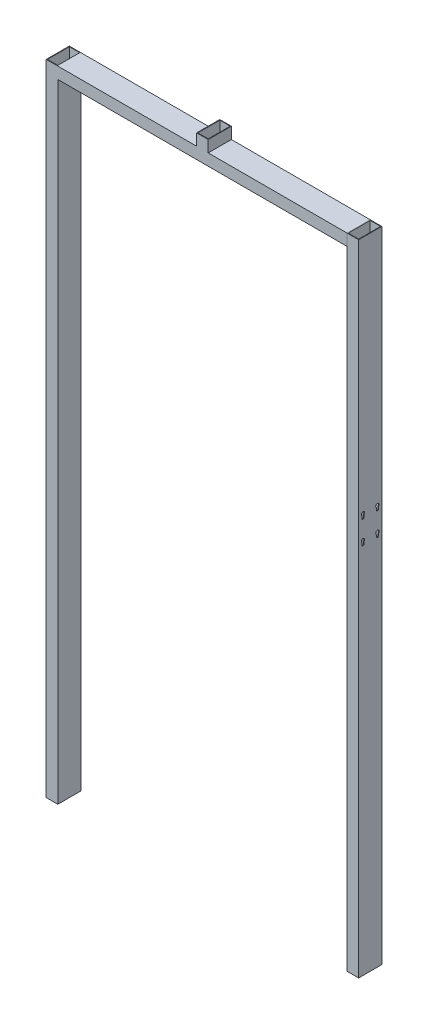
ISO-10303-21;
HEADER;
FILE_DESCRIPTION(('STEP AP214'),'2;1');
FILE_NAME('part.step','',(''),(''),'','','');
FILE_SCHEMA(('AUTOMOTIVE_DESIGN { 1 0 10303 214 1 1 1 1 }'));
ENDSEC;
DATA;
#1=APPLICATION_CONTEXT('core data for automotive mechanical design processes');
#2=APPLICATION_PROTOCOL_DEFINITION('international standard','automotive_design',2000,#1);
#3=PRODUCT_CONTEXT('',#1,'mechanical');
#4=PRODUCT('Part','Part','',(#3));
#5=PRODUCT_RELATED_PRODUCT_CATEGORY('part','',(#4));
#6=PRODUCT_DEFINITION_FORMATION('','',#4);
#7=PRODUCT_DEFINITION_CONTEXT('part definition',#1,'design');
#8=PRODUCT_DEFINITION('design','',#6,#7);
#9=PRODUCT_DEFINITION_SHAPE('','',#8);
#10=(LENGTH_UNIT() NAMED_UNIT(*) SI_UNIT(.MILLI.,.METRE.));
#11=(NAMED_UNIT(*) PLANE_ANGLE_UNIT() SI_UNIT($,.RADIAN.));
#12=(NAMED_UNIT(*) SI_UNIT($,.STERADIAN.) SOLID_ANGLE_UNIT());
#13=UNCERTAINTY_MEASURE_WITH_UNIT(LENGTH_MEASURE(1.E-05),#10,'distance_accuracy_value','');
#14=(GEOMETRIC_REPRESENTATION_CONTEXT(3) GLOBAL_UNCERTAINTY_ASSIGNED_CONTEXT((#13)) GLOBAL_UNIT_ASSIGNED_CONTEXT((#10,
#11,#12)) REPRESENTATION_CONTEXT('',''));
#15=CARTESIAN_POINT('',(0.,0.,0.));
#16=DIRECTION('',(0.,0.,1.));
#17=DIRECTION('',(1.,0.,0.));
#18=AXIS2_PLACEMENT_3D('',#15,#16,#17);
#19=CARTESIAN_POINT('',(-540.,2210.,40.0000000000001));
#20=DIRECTION('',(0.,1.,0.));
#21=DIRECTION('',(0.,0.,1.));
#22=AXIS2_PLACEMENT_3D('',#19,#20,#21);
#23=PLANE('',#22);
#24=DIRECTION('',(0.,0.,1.));
#25=VECTOR('',#24,1.);
#26=CARTESIAN_POINT('',(-20.,2210.,-39.9999999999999));
#27=LINE('',#26,#25);
#28=CARTESIAN_POINT('',(-20.,2210.,-39.9999999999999));
#29=VERTEX_POINT('',#28);
#30=CARTESIAN_POINT('',(-20.,2210.,40.0000000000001));
#31=VERTEX_POINT('',#30);
#32=EDGE_CURVE('E427',#29,#31,#27,.T.);
#33=ORIENTED_EDGE('',*,*,#32,.F.);
#34=DIRECTION('',(-1.,0.,0.));
#35=VECTOR('',#34,1.);
#36=CARTESIAN_POINT('',(-540.,2210.,-39.9999999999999));
#37=LINE('',#36,#35);
#38=CARTESIAN_POINT('',(-540.,2210.,-39.9999999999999));
#39=VERTEX_POINT('',#38);
#40=EDGE_CURVE('E566',#29,#39,#37,.T.);
#41=ORIENTED_EDGE('',*,*,#40,.T.);
#42=DIRECTION('',(0.,0.,1.));
#43=VECTOR('',#42,1.);
#44=CARTESIAN_POINT('',(-540.,2210.,-39.9999999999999));
#45=LINE('',#44,#43);
#46=CARTESIAN_POINT('',(-540.,2210.,40.0000000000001));
#47=VERTEX_POINT('',#46);
#48=EDGE_CURVE('E553',#39,#47,#45,.T.);
#49=ORIENTED_EDGE('',*,*,#48,.T.);
#50=DIRECTION('',(1.,0.,0.));
#51=VECTOR('',#50,1.);
#52=CARTESIAN_POINT('',(-540.,2210.,40.0000000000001));
#53=LINE('',#52,#51);
#54=EDGE_CURVE('E552',#47,#31,#53,.T.);
#55=ORIENTED_EDGE('',*,*,#54,.T.);
#56=EDGE_LOOP('',(#33,#41,#49,#55));
#57=FACE_BOUND('',#56,.T.);
#58=DIRECTION('',(0.,0.,1.));
#59=VECTOR('',#58,1.);
#60=CARTESIAN_POINT('',(-538.,2210.,-37.9999999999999));
#61=LINE('',#60,#59);
#62=CARTESIAN_POINT('',(-538.,2210.,-37.9999999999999));
#63=VERTEX_POINT('',#62);
#64=CARTESIAN_POINT('',(-538.,2210.,38.0000000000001));
#65=VERTEX_POINT('',#64);
#66=EDGE_CURVE('E643',#63,#65,#61,.T.);
#67=ORIENTED_EDGE('',*,*,#66,.F.);
#68=DIRECTION('',(-1.,0.,0.));
#69=VECTOR('',#68,1.);
#70=CARTESIAN_POINT('',(-538.,2210.,-37.9999999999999));
#71=LINE('',#70,#69);
#72=CARTESIAN_POINT('',(-502.,2210.,-37.9999999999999));
#73=VERTEX_POINT('',#72);
#74=EDGE_CURVE('E641',#73,#63,#71,.T.);
#75=ORIENTED_EDGE('',*,*,#74,.F.);
#76=DIRECTION('',(0.,0.,-1.));
#77=VECTOR('',#76,1.);
#78=CARTESIAN_POINT('',(-502.,2210.,-37.9999999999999));
#79=LINE('',#78,#77);
#80=CARTESIAN_POINT('',(-502.,2210.,38.0000000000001));
#81=VERTEX_POINT('',#80);
#82=EDGE_CURVE('E649',#81,#73,#79,.T.);
#83=ORIENTED_EDGE('',*,*,#82,.F.);
#84=DIRECTION('',(1.,0.,0.));
#85=VECTOR('',#84,1.);
#86=CARTESIAN_POINT('',(-538.,2210.,38.0000000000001));
#87=LINE('',#86,#85);
#88=EDGE_CURVE('E646',#65,#81,#87,.T.);
#89=ORIENTED_EDGE('',*,*,#88,.F.);
#90=EDGE_LOOP('',(#67,#75,#83,#89));
#91=FACE_BOUND('',#90,.T.);
#92=ADVANCED_FACE('F66',(#57,#91),#23,.T.);
#93=CARTESIAN_POINT('',(-500.,2210.,-39.9999999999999));
#94=DIRECTION('',(-1.,0.,0.));
#95=DIRECTION('',(0.,0.,1.));
#96=AXIS2_PLACEMENT_3D('',#93,#94,#95);
#97=PLANE('',#96);
#98=DIRECTION('',(0.,0.,-1.));
#99=VECTOR('',#98,1.);
#100=CARTESIAN_POINT('',(-500.,2170.,40.0000000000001));
#101=LINE('',#100,#99);
#102=CARTESIAN_POINT('',(-500.,2170.,40.0000000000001));
#103=VERTEX_POINT('',#102);
#104=CARTESIAN_POINT('',(-500.,2170.,-39.9999999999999));
#105=VERTEX_POINT('',#104);
#106=EDGE_CURVE('E605',#103,#105,#101,.T.);
#107=ORIENTED_EDGE('',*,*,#106,.F.);
#108=DIRECTION('',(0.,-1.,0.));
#109=VECTOR('',#108,1.);
#110=CARTESIAN_POINT('',(-500.,2210.,40.0000000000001));
#111=LINE('',#110,#109);
#112=CARTESIAN_POINT('',(-500.,0.,40.0000000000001));
#113=VERTEX_POINT('',#112);
#114=EDGE_CURVE('E596',#103,#113,#111,.T.);
#115=ORIENTED_EDGE('',*,*,#114,.T.);
#116=DIRECTION('',(0.,0.,-1.));
#117=VECTOR('',#116,1.);
#118=CARTESIAN_POINT('',(-500.,0.,-39.9999999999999));
#119=LINE('',#118,#117);
#120=CARTESIAN_POINT('',(-500.,0.,-39.9999999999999));
#121=VERTEX_POINT('',#120);
#122=EDGE_CURVE('E581',#113,#121,#119,.T.);
#123=ORIENTED_EDGE('',*,*,#122,.T.);
#124=DIRECTION('',(0.,-1.,0.));
#125=VECTOR('',#124,1.);
#126=CARTESIAN_POINT('',(-500.,2210.,-39.9999999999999));
#127=LINE('',#126,#125);
#128=EDGE_CURVE('E589',#105,#121,#127,.T.);
#129=ORIENTED_EDGE('',*,*,#128,.F.);
#130=EDGE_LOOP('',(#107,#115,#123,#129));
#131=FACE_BOUND('',#130,.T.);
#132=ADVANCED_FACE('F507',(#131),#97,.F.);
#133=DIRECTION('',(0.,0.,-1.));
#134=VECTOR('',#133,1.);
#135=CARTESIAN_POINT('',(20.,2210.,-39.9999999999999));
#136=LINE('',#135,#134);
#137=CARTESIAN_POINT('',(20.,2210.,40.0000000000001));
#138=VERTEX_POINT('',#137);
#139=CARTESIAN_POINT('',(20.,2210.,-39.9999999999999));
#140=VERTEX_POINT('',#139);
#141=EDGE_CURVE('E432',#138,#140,#136,.T.);
#142=ORIENTED_EDGE('',*,*,#141,.F.);
#143=CARTESIAN_POINT('',(500.000000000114,2210.,40.0000000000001));
#144=VERTEX_POINT('',#143);
#145=EDGE_CURVE('E535',#138,#144,#53,.T.);
#146=ORIENTED_EDGE('',*,*,#145,.T.);
#147=DIRECTION('',(0.,0.,1.));
#148=VECTOR('',#147,1.);
#149=CARTESIAN_POINT('',(500.,2210.,-39.9999999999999));
#150=LINE('',#149,#148);
#151=CARTESIAN_POINT('',(500.000000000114,2210.,-39.9999999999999));
#152=VERTEX_POINT('',#151);
#153=EDGE_CURVE('E559',#152,#144,#150,.T.);
#154=ORIENTED_EDGE('',*,*,#153,.F.);
#155=EDGE_CURVE('E537',#152,#140,#37,.T.);
#156=ORIENTED_EDGE('',*,*,#155,.T.);
#157=EDGE_LOOP('',(#142,#146,#154,#156));
#158=FACE_BOUND('',#157,.T.);
#159=ADVANCED_FACE('F511',(#158),#23,.T.);
#160=CARTESIAN_POINT('',(-540.,0.,40.0000000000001));
#161=DIRECTION('',(0.,1.,0.));
#162=DIRECTION('',(0.,0.,1.));
#163=AXIS2_PLACEMENT_3D('',#160,#161,#162);
#164=PLANE('',#163);
#165=DIRECTION('',(0.,0.,1.));
#166=VECTOR('',#165,1.);
#167=CARTESIAN_POINT('',(-540.,0.,-39.9999999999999));
#168=LINE('',#167,#166);
#169=CARTESIAN_POINT('',(-540.,0.,-39.9999999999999));
#170=VERTEX_POINT('',#169);
#171=CARTESIAN_POINT('',(-540.,0.,40.0000000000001));
#172=VERTEX_POINT('',#171);
#173=EDGE_CURVE('E574',#170,#172,#168,.T.);
#174=ORIENTED_EDGE('',*,*,#173,.F.);
#175=DIRECTION('',(-1.,0.,0.));
#176=VECTOR('',#175,1.);
#177=CARTESIAN_POINT('',(-540.,0.,-39.9999999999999));
#178=LINE('',#177,#176);
#179=EDGE_CURVE('E584',#121,#170,#178,.T.);
#180=ORIENTED_EDGE('',*,*,#179,.F.);
#181=ORIENTED_EDGE('',*,*,#122,.F.);
#182=DIRECTION('',(1.,0.,0.));
#183=VECTOR('',#182,1.);
#184=CARTESIAN_POINT('',(-540.,0.,40.0000000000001));
#185=LINE('',#184,#183);
#186=EDGE_CURVE('E578',#172,#113,#185,.T.);
#187=ORIENTED_EDGE('',*,*,#186,.F.);
#188=EDGE_LOOP('',(#174,#180,#181,#187));
#189=FACE_BOUND('',#188,.T.);
#190=DIRECTION('',(-1.,0.,0.));
#191=VECTOR('',#190,1.);
#192=CARTESIAN_POINT('',(-538.,0.,-37.9999999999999));
#193=LINE('',#192,#191);
#194=CARTESIAN_POINT('',(-502.,0.,-37.9999999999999));
#195=VERTEX_POINT('',#194);
#196=CARTESIAN_POINT('',(-538.,0.,-37.9999999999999));
#197=VERTEX_POINT('',#196);
#198=EDGE_CURVE('E609',#195,#197,#193,.T.);
#199=ORIENTED_EDGE('',*,*,#198,.T.);
#200=DIRECTION('',(0.,0.,1.));
#201=VECTOR('',#200,1.);
#202=CARTESIAN_POINT('',(-538.,0.,-37.9999999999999));
#203=LINE('',#202,#201);
#204=CARTESIAN_POINT('',(-538.,0.,38.0000000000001));
#205=VERTEX_POINT('',#204);
#206=EDGE_CURVE('E654',#197,#205,#203,.T.);
#207=ORIENTED_EDGE('',*,*,#206,.T.);
#208=DIRECTION('',(1.,0.,0.));
#209=VECTOR('',#208,1.);
#210=CARTESIAN_POINT('',(-538.,0.,38.0000000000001));
#211=LINE('',#210,#209);
#212=CARTESIAN_POINT('',(-502.,0.,38.0000000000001));
#213=VERTEX_POINT('',#212);
#214=EDGE_CURVE('E657',#205,#213,#211,.T.);
#215=ORIENTED_EDGE('',*,*,#214,.T.);
#216=DIRECTION('',(0.,0.,-1.));
#217=VECTOR('',#216,1.);
#218=CARTESIAN_POINT('',(-502.,0.,-37.9999999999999));
#219=LINE('',#218,#217);
#220=EDGE_CURVE('E644',#213,#195,#219,.T.);
#221=ORIENTED_EDGE('',*,*,#220,.T.);
#222=EDGE_LOOP('',(#199,#207,#215,#221));
#223=FACE_BOUND('',#222,.T.);
#224=ADVANCED_FACE('F526',(#189,#223),#164,.F.);
#225=CARTESIAN_POINT('',(-540.,2210.,-39.9999999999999));
#226=DIRECTION('',(1.,0.,0.));
#227=DIRECTION('',(0.,0.,-1.));
#228=AXIS2_PLACEMENT_3D('',#225,#226,#227);
#229=PLANE('',#228);
#230=DIRECTION('',(0.,1.,0.));
#231=VECTOR('',#230,1.);
#232=CARTESIAN_POINT('',(-540.,1290.,29.0000000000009));
#233=LINE('',#232,#231);
#234=CARTESIAN_POINT('',(-540.,1290.,29.0000000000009));
#235=VERTEX_POINT('',#234);
#236=CARTESIAN_POINT('',(-540.,1297.527864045,29.0000000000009));
#237=VERTEX_POINT('',#236);
#238=EDGE_CURVE('E322',#235,#237,#233,.T.);
#239=ORIENTED_EDGE('',*,*,#238,.F.);
#240=CARTESIAN_POINT('',(-540.,1290.,25.0000000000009));
#241=DIRECTION('',(-1.,0.,0.));
#242=DIRECTION('',(0.,0.,1.));
#243=AXIS2_PLACEMENT_3D('',#240,#241,#242);
#244=CIRCLE('',#243,4.);
#245=CARTESIAN_POINT('',(-540.,1290.,21.0000000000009));
#246=VERTEX_POINT('',#245);
#247=EDGE_CURVE('E81',#246,#235,#244,.T.);
#248=ORIENTED_EDGE('',*,*,#247,.F.);
#249=DIRECTION('',(0.,-1.,0.));
#250=VECTOR('',#249,1.);
#251=CARTESIAN_POINT('',(-540.,1290.,21.0000000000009));
#252=LINE('',#251,#250);
#253=CARTESIAN_POINT('',(-540.,1297.527864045,21.0000000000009));
#254=VERTEX_POINT('',#253);
#255=EDGE_CURVE('E328',#254,#246,#252,.T.);
#256=ORIENTED_EDGE('',*,*,#255,.F.);
#257=CARTESIAN_POINT('',(-540.,1302.,25.0000000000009));
#258=DIRECTION('',(-1.,0.,0.));
#259=DIRECTION('',(0.,0.,1.));
#260=AXIS2_PLACEMENT_3D('',#257,#258,#259);
#261=CIRCLE('',#260,5.99999999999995);
#262=EDGE_CURVE('E313',#237,#254,#261,.T.);
#263=ORIENTED_EDGE('',*,*,#262,.F.);
#264=EDGE_LOOP('',(#239,#248,#256,#263));
#265=FACE_BOUND('',#264,.T.);
#266=DIRECTION('',(0.,1.,0.));
#267=VECTOR('',#266,1.);
#268=CARTESIAN_POINT('',(-540.,1290.,-20.9999999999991));
#269=LINE('',#268,#267);
#270=CARTESIAN_POINT('',(-540.,1290.,-20.9999999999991));
#271=VERTEX_POINT('',#270);
#272=CARTESIAN_POINT('',(-540.,1297.527864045,-20.9999999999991));
#273=VERTEX_POINT('',#272);
#274=EDGE_CURVE('E339',#271,#273,#269,.T.);
#275=ORIENTED_EDGE('',*,*,#274,.F.);
#276=CARTESIAN_POINT('',(-540.,1290.,-24.9999999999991));
#277=DIRECTION('',(-1.,0.,0.));
#278=DIRECTION('',(0.,0.,1.));
#279=AXIS2_PLACEMENT_3D('',#276,#277,#278);
#280=CIRCLE('',#279,4.);
#281=CARTESIAN_POINT('',(-540.,1290.,-28.9999999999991));
#282=VERTEX_POINT('',#281);
#283=EDGE_CURVE('E335',#282,#271,#280,.T.);
#284=ORIENTED_EDGE('',*,*,#283,.F.);
#285=DIRECTION('',(0.,-1.,0.));
#286=VECTOR('',#285,1.);
#287=CARTESIAN_POINT('',(-540.,1290.,-28.9999999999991));
#288=LINE('',#287,#286);
#289=CARTESIAN_POINT('',(-540.,1297.527864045,-28.9999999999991));
#290=VERTEX_POINT('',#289);
#291=EDGE_CURVE('E345',#290,#282,#288,.T.);
#292=ORIENTED_EDGE('',*,*,#291,.F.);
#293=CARTESIAN_POINT('',(-540.,1302.,-24.9999999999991));
#294=DIRECTION('',(-1.,0.,0.));
#295=DIRECTION('',(0.,0.,1.));
#296=AXIS2_PLACEMENT_3D('',#293,#294,#295);
#297=CIRCLE('',#296,5.99999999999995);
#298=EDGE_CURVE('E342',#273,#290,#297,.T.);
#299=ORIENTED_EDGE('',*,*,#298,.F.);
#300=EDGE_LOOP('',(#275,#284,#292,#299));
#301=FACE_BOUND('',#300,.T.);
#302=DIRECTION('',(0.,1.,0.));
#303=VECTOR('',#302,1.);
#304=CARTESIAN_POINT('',(-540.,1370.,29.0000000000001));
#305=LINE('',#304,#303);
#306=CARTESIAN_POINT('',(-540.,1370.,29.0000000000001));
#307=VERTEX_POINT('',#306);
#308=CARTESIAN_POINT('',(-540.,1377.527864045,29.0000000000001));
#309=VERTEX_POINT('',#308);
#310=EDGE_CURVE('E359',#307,#309,#305,.T.);
#311=ORIENTED_EDGE('',*,*,#310,.F.);
#312=CARTESIAN_POINT('',(-540.,1370.,25.0000000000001));
#313=DIRECTION('',(-1.,0.,0.));
#314=DIRECTION('',(0.,0.,1.));
#315=AXIS2_PLACEMENT_3D('',#312,#313,#314);
#316=CIRCLE('',#315,4.);
#317=CARTESIAN_POINT('',(-540.,1370.,21.0000000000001));
#318=VERTEX_POINT('',#317);
#319=EDGE_CURVE('E351',#318,#307,#316,.T.);
#320=ORIENTED_EDGE('',*,*,#319,.F.);
#321=DIRECTION('',(0.,-1.,0.));
#322=VECTOR('',#321,1.);
#323=CARTESIAN_POINT('',(-540.,1370.,21.0000000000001));
#324=LINE('',#323,#322);
#325=CARTESIAN_POINT('',(-540.,1377.527864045,21.0000000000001));
#326=VERTEX_POINT('',#325);
#327=EDGE_CURVE('E365',#326,#318,#324,.T.);
#328=ORIENTED_EDGE('',*,*,#327,.F.);
#329=CARTESIAN_POINT('',(-540.,1382.,25.0000000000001));
#330=DIRECTION('',(-1.,0.,0.));
#331=DIRECTION('',(0.,0.,1.));
#332=AXIS2_PLACEMENT_3D('',#329,#330,#331);
#333=CIRCLE('',#332,5.99999999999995);
#334=EDGE_CURVE('E362',#309,#326,#333,.T.);
#335=ORIENTED_EDGE('',*,*,#334,.F.);
#336=EDGE_LOOP('',(#311,#320,#328,#335));
#337=FACE_BOUND('',#336,.T.);
#338=DIRECTION('',(0.,1.,0.));
#339=VECTOR('',#338,1.);
#340=CARTESIAN_POINT('',(-540.,1370.,-20.9999999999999));
#341=LINE('',#340,#339);
#342=CARTESIAN_POINT('',(-540.,1370.,-20.9999999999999));
#343=VERTEX_POINT('',#342);
#344=CARTESIAN_POINT('',(-540.,1377.527864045,-20.9999999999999));
#345=VERTEX_POINT('',#344);
#346=EDGE_CURVE('E379',#343,#345,#341,.T.);
#347=ORIENTED_EDGE('',*,*,#346,.F.);
#348=CARTESIAN_POINT('',(-540.,1370.,-24.9999999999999));
#349=DIRECTION('',(-1.,0.,0.));
#350=DIRECTION('',(0.,0.,1.));
#351=AXIS2_PLACEMENT_3D('',#348,#349,#350);
#352=CIRCLE('',#351,4.);
#353=CARTESIAN_POINT('',(-540.,1370.,-28.9999999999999));
#354=VERTEX_POINT('',#353);
#355=EDGE_CURVE('E371',#354,#343,#352,.T.);
#356=ORIENTED_EDGE('',*,*,#355,.F.);
#357=DIRECTION('',(0.,-1.,0.));
#358=VECTOR('',#357,1.);
#359=CARTESIAN_POINT('',(-540.,1370.,-28.9999999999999));
#360=LINE('',#359,#358);
#361=CARTESIAN_POINT('',(-540.,1377.527864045,-28.9999999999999));
#362=VERTEX_POINT('',#361);
#363=EDGE_CURVE('E385',#362,#354,#360,.T.);
#364=ORIENTED_EDGE('',*,*,#363,.F.);
#365=CARTESIAN_POINT('',(-540.,1382.,-24.9999999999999));
#366=DIRECTION('',(-1.,0.,0.));
#367=DIRECTION('',(0.,0.,1.));
#368=AXIS2_PLACEMENT_3D('',#365,#366,#367);
#369=CIRCLE('',#368,5.99999999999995);
#370=EDGE_CURVE('E382',#345,#362,#369,.T.);
#371=ORIENTED_EDGE('',*,*,#370,.F.);
#372=EDGE_LOOP('',(#347,#356,#364,#371));
#373=FACE_BOUND('',#372,.T.);
#374=ORIENTED_EDGE('',*,*,#173,.T.);
#375=DIRECTION('',(0.,-1.,0.));
#376=VECTOR('',#375,1.);
#377=CARTESIAN_POINT('',(-540.,2210.,40.0000000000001));
#378=LINE('',#377,#376);
#379=EDGE_CURVE('E457',#47,#172,#378,.T.);
#380=ORIENTED_EDGE('',*,*,#379,.F.);
#381=ORIENTED_EDGE('',*,*,#48,.F.);
#382=DIRECTION('',(0.,-1.,0.));
#383=VECTOR('',#382,1.);
#384=CARTESIAN_POINT('',(-540.,2210.,-39.9999999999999));
#385=LINE('',#384,#383);
#386=EDGE_CURVE('E586',#39,#170,#385,.T.);
#387=ORIENTED_EDGE('',*,*,#386,.T.);
#388=EDGE_LOOP('',(#374,#380,#381,#387));
#389=FACE_BOUND('',#388,.T.);
#390=ADVANCED_FACE('F68',(#265,#301,#337,#373,#389),#229,.F.);
#391=CARTESIAN_POINT('',(-540.,2210.,40.0000000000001));
#392=DIRECTION('',(0.,0.,-1.));
#393=DIRECTION('',(-1.,0.,0.));
#394=AXIS2_PLACEMENT_3D('',#391,#392,#393);
#395=PLANE('',#394);
#396=ORIENTED_EDGE('',*,*,#186,.T.);
#397=ORIENTED_EDGE('',*,*,#114,.F.);
#398=DIRECTION('',(-1.,0.,0.));
#399=VECTOR('',#398,1.);
#400=CARTESIAN_POINT('',(500000.,2170.,40.0000000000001));
#401=LINE('',#400,#399);
#402=CARTESIAN_POINT('',(500.000000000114,2170.,40.0000000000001));
#403=VERTEX_POINT('',#402);
#404=EDGE_CURVE('E602',#403,#103,#401,.T.);
#405=ORIENTED_EDGE('',*,*,#404,.F.);
#406=DIRECTION('',(0.,-1.,0.));
#407=VECTOR('',#406,1.);
#408=CARTESIAN_POINT('',(500.,2210.,40.0000000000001));
#409=LINE('',#408,#407);
#410=EDGE_CURVE('E550',#144,#403,#409,.T.);
#411=ORIENTED_EDGE('',*,*,#410,.F.);
#412=ORIENTED_EDGE('',*,*,#145,.F.);
#413=DIRECTION('',(0.,-1.,0.));
#414=VECTOR('',#413,1.);
#415=CARTESIAN_POINT('',(20.,2250.,40.0000000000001));
#416=LINE('',#415,#414);
#417=CARTESIAN_POINT('',(20.,2250.,40.0000000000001));
#418=VERTEX_POINT('',#417);
#419=EDGE_CURVE('E547',#418,#138,#416,.T.);
#420=ORIENTED_EDGE('',*,*,#419,.F.);
#421=DIRECTION('',(1.,0.,0.));
#422=VECTOR('',#421,1.);
#423=CARTESIAN_POINT('',(-20.,2250.,40.0000000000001));
#424=LINE('',#423,#422);
#425=CARTESIAN_POINT('',(-20.,2250.,40.0000000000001));
#426=VERTEX_POINT('',#425);
#427=EDGE_CURVE('E431',#426,#418,#424,.T.);
#428=ORIENTED_EDGE('',*,*,#427,.F.);
#429=DIRECTION('',(0.,-1.,0.));
#430=VECTOR('',#429,1.);
#431=CARTESIAN_POINT('',(-20.,2250.,40.0000000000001));
#432=LINE('',#431,#430);
#433=EDGE_CURVE('E556',#426,#31,#432,.T.);
#434=ORIENTED_EDGE('',*,*,#433,.T.);
#435=ORIENTED_EDGE('',*,*,#54,.F.);
#436=ORIENTED_EDGE('',*,*,#379,.T.);
#437=EDGE_LOOP('',(#396,#397,#405,#411,#412,#420,#428,#434,#435,#436));
#438=FACE_BOUND('',#437,.T.);
#439=ADVANCED_FACE('F546',(#438),#395,.F.);
#440=CARTESIAN_POINT('',(-540.,2210.,-39.9999999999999));
#441=DIRECTION('',(0.,0.,1.));
#442=DIRECTION('',(1.,0.,0.));
#443=AXIS2_PLACEMENT_3D('',#440,#441,#442);
#444=PLANE('',#443);
#445=ORIENTED_EDGE('',*,*,#179,.T.);
#446=ORIENTED_EDGE('',*,*,#386,.F.);
#447=ORIENTED_EDGE('',*,*,#40,.F.);
#448=DIRECTION('',(0.,-1.,0.));
#449=VECTOR('',#448,1.);
#450=CARTESIAN_POINT('',(-20.,2250.,-39.9999999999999));
#451=LINE('',#450,#449);
#452=CARTESIAN_POINT('',(-20.,2250.,-39.9999999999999));
#453=VERTEX_POINT('',#452);
#454=EDGE_CURVE('E438',#453,#29,#451,.T.);
#455=ORIENTED_EDGE('',*,*,#454,.F.);
#456=DIRECTION('',(-1.,0.,0.));
#457=VECTOR('',#456,1.);
#458=CARTESIAN_POINT('',(-20.,2250.,-39.9999999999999));
#459=LINE('',#458,#457);
#460=CARTESIAN_POINT('',(20.,2250.,-39.9999999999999));
#461=VERTEX_POINT('',#460);
#462=EDGE_CURVE('E436',#461,#453,#459,.T.);
#463=ORIENTED_EDGE('',*,*,#462,.F.);
#464=DIRECTION('',(0.,-1.,0.));
#465=VECTOR('',#464,1.);
#466=CARTESIAN_POINT('',(20.,2250.,-39.9999999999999));
#467=LINE('',#466,#465);
#468=EDGE_CURVE('E451',#461,#140,#467,.T.);
#469=ORIENTED_EDGE('',*,*,#468,.T.);
#470=ORIENTED_EDGE('',*,*,#155,.F.);
#471=DIRECTION('',(0.,-1.,0.));
#472=VECTOR('',#471,1.);
#473=CARTESIAN_POINT('',(500.,2210.,-39.9999999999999));
#474=LINE('',#473,#472);
#475=CARTESIAN_POINT('',(500.000000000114,2170.,-39.9999999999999));
#476=VERTEX_POINT('',#475);
#477=EDGE_CURVE('E615',#152,#476,#474,.T.);
#478=ORIENTED_EDGE('',*,*,#477,.T.);
#479=DIRECTION('',(-1.,0.,0.));
#480=VECTOR('',#479,1.);
#481=CARTESIAN_POINT('',(500000.,2170.,-39.9999999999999));
#482=LINE('',#481,#480);
#483=EDGE_CURVE('E598',#476,#105,#482,.T.);
#484=ORIENTED_EDGE('',*,*,#483,.T.);
#485=ORIENTED_EDGE('',*,*,#128,.T.);
#486=EDGE_LOOP('',(#445,#446,#447,#455,#463,#469,#470,#478,#484,#485));
#487=FACE_BOUND('',#486,.T.);
#488=ADVANCED_FACE('F687',(#487),#444,.F.);
#489=CARTESIAN_POINT('',(-538.,2210.,-37.9999999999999));
#490=DIRECTION('',(0.,0.,1.));
#491=DIRECTION('',(1.,0.,0.));
#492=AXIS2_PLACEMENT_3D('',#489,#490,#491);
#493=PLANE('',#492);
#494=ORIENTED_EDGE('',*,*,#198,.F.);
#495=DIRECTION('',(0.,-1.,0.));
#496=VECTOR('',#495,1.);
#497=CARTESIAN_POINT('',(-502.,2210.,-37.9999999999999));
#498=LINE('',#497,#496);
#499=EDGE_CURVE('E651',#73,#195,#498,.T.);
#500=ORIENTED_EDGE('',*,*,#499,.F.);
#501=ORIENTED_EDGE('',*,*,#74,.T.);
#502=DIRECTION('',(0.,-1.,0.));
#503=VECTOR('',#502,1.);
#504=CARTESIAN_POINT('',(-538.,2210.,-37.9999999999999));
#505=LINE('',#504,#503);
#506=EDGE_CURVE('E579',#63,#197,#505,.T.);
#507=ORIENTED_EDGE('',*,*,#506,.T.);
#508=EDGE_LOOP('',(#494,#500,#501,#507));
#509=FACE_BOUND('',#508,.T.);
#510=ADVANCED_FACE('F745',(#509),#493,.T.);
#511=CARTESIAN_POINT('',(-538.,2210.,-37.9999999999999));
#512=DIRECTION('',(1.,0.,0.));
#513=DIRECTION('',(0.,0.,-1.));
#514=AXIS2_PLACEMENT_3D('',#511,#512,#513);
#515=PLANE('',#514);
#516=CARTESIAN_POINT('',(-538.,1290.,25.0000000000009));
#517=DIRECTION('',(1.,0.,0.));
#518=DIRECTION('',(0.,0.,-1.));
#519=AXIS2_PLACEMENT_3D('',#516,#517,#518);
#520=CIRCLE('',#519,4.);
#521=CARTESIAN_POINT('',(-538.,1290.,29.0000000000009));
#522=VERTEX_POINT('',#521);
#523=CARTESIAN_POINT('',(-538.,1290.,21.0000000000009));
#524=VERTEX_POINT('',#523);
#525=EDGE_CURVE('E13',#522,#524,#520,.T.);
#526=ORIENTED_EDGE('',*,*,#525,.F.);
#527=DIRECTION('',(0.,-1.,0.));
#528=VECTOR('',#527,1.);
#529=CARTESIAN_POINT('',(-538.,2210.,29.0000000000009));
#530=LINE('',#529,#528);
#531=CARTESIAN_POINT('',(-538.,1297.527864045,29.0000000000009));
#532=VERTEX_POINT('',#531);
#533=EDGE_CURVE('E482',#532,#522,#530,.T.);
#534=ORIENTED_EDGE('',*,*,#533,.F.);
#535=CARTESIAN_POINT('',(-538.,1302.,25.0000000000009));
#536=DIRECTION('',(1.,0.,0.));
#537=DIRECTION('',(0.,0.,-1.));
#538=AXIS2_PLACEMENT_3D('',#535,#536,#537);
#539=CIRCLE('',#538,5.99999999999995);
#540=CARTESIAN_POINT('',(-538.,1297.527864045,21.0000000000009));
#541=VERTEX_POINT('',#540);
#542=EDGE_CURVE('E316',#541,#532,#539,.T.);
#543=ORIENTED_EDGE('',*,*,#542,.F.);
#544=DIRECTION('',(0.,1.,0.));
#545=VECTOR('',#544,1.);
#546=CARTESIAN_POINT('',(-538.,2210.,21.0000000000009));
#547=LINE('',#546,#545);
#548=EDGE_CURVE('E74',#524,#541,#547,.T.);
#549=ORIENTED_EDGE('',*,*,#548,.F.);
#550=EDGE_LOOP('',(#526,#534,#543,#549));
#551=FACE_BOUND('',#550,.T.);
#552=CARTESIAN_POINT('',(-538.,1290.,-24.9999999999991));
#553=DIRECTION('',(1.,0.,0.));
#554=DIRECTION('',(0.,0.,-1.));
#555=AXIS2_PLACEMENT_3D('',#552,#553,#554);
#556=CIRCLE('',#555,4.);
#557=CARTESIAN_POINT('',(-538.,1290.,-20.9999999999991));
#558=VERTEX_POINT('',#557);
#559=CARTESIAN_POINT('',(-538.,1290.,-28.9999999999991));
#560=VERTEX_POINT('',#559);
#561=EDGE_CURVE('E480',#558,#560,#556,.T.);
#562=ORIENTED_EDGE('',*,*,#561,.F.);
#563=DIRECTION('',(0.,-1.,0.));
#564=VECTOR('',#563,1.);
#565=CARTESIAN_POINT('',(-538.,2210.,-20.9999999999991));
#566=LINE('',#565,#564);
#567=CARTESIAN_POINT('',(-538.,1297.527864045,-20.9999999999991));
#568=VERTEX_POINT('',#567);
#569=EDGE_CURVE('E473',#568,#558,#566,.T.);
#570=ORIENTED_EDGE('',*,*,#569,.F.);
#571=CARTESIAN_POINT('',(-538.,1302.,-24.9999999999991));
#572=DIRECTION('',(1.,0.,0.));
#573=DIRECTION('',(0.,0.,-1.));
#574=AXIS2_PLACEMENT_3D('',#571,#572,#573);
#575=CIRCLE('',#574,5.99999999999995);
#576=CARTESIAN_POINT('',(-538.,1297.527864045,-28.9999999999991));
#577=VERTEX_POINT('',#576);
#578=EDGE_CURVE('E475',#577,#568,#575,.T.);
#579=ORIENTED_EDGE('',*,*,#578,.F.);
#580=DIRECTION('',(0.,1.,0.));
#581=VECTOR('',#580,1.);
#582=CARTESIAN_POINT('',(-538.,2210.,-28.9999999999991));
#583=LINE('',#582,#581);
#584=EDGE_CURVE('E478',#560,#577,#583,.T.);
#585=ORIENTED_EDGE('',*,*,#584,.F.);
#586=EDGE_LOOP('',(#562,#570,#579,#585));
#587=FACE_BOUND('',#586,.T.);
#588=CARTESIAN_POINT('',(-538.,1370.,25.0000000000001));
#589=DIRECTION('',(1.,0.,0.));
#590=DIRECTION('',(0.,0.,-1.));
#591=AXIS2_PLACEMENT_3D('',#588,#589,#590);
#592=CIRCLE('',#591,4.);
#593=CARTESIAN_POINT('',(-538.,1370.,29.0000000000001));
#594=VERTEX_POINT('',#593);
#595=CARTESIAN_POINT('',(-538.,1370.,21.0000000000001));
#596=VERTEX_POINT('',#595);
#597=EDGE_CURVE('E471',#594,#596,#592,.T.);
#598=ORIENTED_EDGE('',*,*,#597,.F.);
#599=DIRECTION('',(0.,-1.,0.));
#600=VECTOR('',#599,1.);
#601=CARTESIAN_POINT('',(-538.,2210.,29.0000000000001));
#602=LINE('',#601,#600);
#603=CARTESIAN_POINT('',(-538.,1377.527864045,29.0000000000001));
#604=VERTEX_POINT('',#603);
#605=EDGE_CURVE('E464',#604,#594,#602,.T.);
#606=ORIENTED_EDGE('',*,*,#605,.F.);
#607=CARTESIAN_POINT('',(-538.,1382.,25.0000000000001));
#608=DIRECTION('',(1.,0.,0.));
#609=DIRECTION('',(0.,0.,-1.));
#610=AXIS2_PLACEMENT_3D('',#607,#608,#609);
#611=CIRCLE('',#610,5.99999999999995);
#612=CARTESIAN_POINT('',(-538.,1377.527864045,21.0000000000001));
#613=VERTEX_POINT('',#612);
#614=EDGE_CURVE('E466',#613,#604,#611,.T.);
#615=ORIENTED_EDGE('',*,*,#614,.F.);
#616=DIRECTION('',(0.,1.,0.));
#617=VECTOR('',#616,1.);
#618=CARTESIAN_POINT('',(-538.,2210.,21.0000000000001));
#619=LINE('',#618,#617);
#620=EDGE_CURVE('E469',#596,#613,#619,.T.);
#621=ORIENTED_EDGE('',*,*,#620,.F.);
#622=EDGE_LOOP('',(#598,#606,#615,#621));
#623=FACE_BOUND('',#622,.T.);
#624=CARTESIAN_POINT('',(-538.,1370.,-24.9999999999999));
#625=DIRECTION('',(1.,0.,0.));
#626=DIRECTION('',(0.,0.,-1.));
#627=AXIS2_PLACEMENT_3D('',#624,#625,#626);
#628=CIRCLE('',#627,4.);
#629=CARTESIAN_POINT('',(-538.,1370.,-20.9999999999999));
#630=VERTEX_POINT('',#629);
#631=CARTESIAN_POINT('',(-538.,1370.,-28.9999999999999));
#632=VERTEX_POINT('',#631);
#633=EDGE_CURVE('E462',#630,#632,#628,.T.);
#634=ORIENTED_EDGE('',*,*,#633,.F.);
#635=DIRECTION('',(0.,-1.,0.));
#636=VECTOR('',#635,1.);
#637=CARTESIAN_POINT('',(-538.,2210.,-20.9999999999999));
#638=LINE('',#637,#636);
#639=CARTESIAN_POINT('',(-538.,1377.527864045,-20.9999999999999));
#640=VERTEX_POINT('',#639);
#641=EDGE_CURVE('E454',#640,#630,#638,.T.);
#642=ORIENTED_EDGE('',*,*,#641,.F.);
#643=CARTESIAN_POINT('',(-538.,1382.,-24.9999999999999));
#644=DIRECTION('',(1.,0.,0.));
#645=DIRECTION('',(0.,0.,-1.));
#646=AXIS2_PLACEMENT_3D('',#643,#644,#645);
#647=CIRCLE('',#646,5.99999999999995);
#648=CARTESIAN_POINT('',(-538.,1377.527864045,-28.9999999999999));
#649=VERTEX_POINT('',#648);
#650=EDGE_CURVE('E456',#649,#640,#647,.T.);
#651=ORIENTED_EDGE('',*,*,#650,.F.);
#652=DIRECTION('',(0.,1.,0.));
#653=VECTOR('',#652,1.);
#654=CARTESIAN_POINT('',(-538.,2210.,-28.9999999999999));
#655=LINE('',#654,#653);
#656=EDGE_CURVE('E460',#632,#649,#655,.T.);
#657=ORIENTED_EDGE('',*,*,#656,.F.);
#658=EDGE_LOOP('',(#634,#642,#651,#657));
#659=FACE_BOUND('',#658,.T.);
#660=ORIENTED_EDGE('',*,*,#206,.F.);
#661=ORIENTED_EDGE('',*,*,#506,.F.);
#662=ORIENTED_EDGE('',*,*,#66,.T.);
#663=DIRECTION('',(0.,-1.,0.));
#664=VECTOR('',#663,1.);
#665=CARTESIAN_POINT('',(-538.,2210.,38.0000000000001));
#666=LINE('',#665,#664);
#667=EDGE_CURVE('E666',#65,#205,#666,.T.);
#668=ORIENTED_EDGE('',*,*,#667,.T.);
#669=EDGE_LOOP('',(#660,#661,#662,#668));
#670=FACE_BOUND('',#669,.T.);
#671=ADVANCED_FACE('F490',(#551,#587,#623,#659,#670),#515,.T.);
#672=CARTESIAN_POINT('',(-538.,2210.,38.0000000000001));
#673=DIRECTION('',(0.,0.,-1.));
#674=DIRECTION('',(-1.,0.,0.));
#675=AXIS2_PLACEMENT_3D('',#672,#673,#674);
#676=PLANE('',#675);
#677=ORIENTED_EDGE('',*,*,#214,.F.);
#678=ORIENTED_EDGE('',*,*,#667,.F.);
#679=ORIENTED_EDGE('',*,*,#88,.T.);
#680=DIRECTION('',(0.,-1.,0.));
#681=VECTOR('',#680,1.);
#682=CARTESIAN_POINT('',(-502.,2210.,38.0000000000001));
#683=LINE('',#682,#681);
#684=EDGE_CURVE('E664',#81,#213,#683,.T.);
#685=ORIENTED_EDGE('',*,*,#684,.T.);
#686=EDGE_LOOP('',(#677,#678,#679,#685));
#687=FACE_BOUND('',#686,.T.);
#688=ADVANCED_FACE('F723',(#687),#676,.T.);
#689=CARTESIAN_POINT('',(-502.,2210.,-37.9999999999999));
#690=DIRECTION('',(-1.,0.,0.));
#691=DIRECTION('',(0.,0.,1.));
#692=AXIS2_PLACEMENT_3D('',#689,#690,#691);
#693=PLANE('',#692);
#694=ORIENTED_EDGE('',*,*,#220,.F.);
#695=ORIENTED_EDGE('',*,*,#684,.F.);
#696=ORIENTED_EDGE('',*,*,#82,.T.);
#697=ORIENTED_EDGE('',*,*,#499,.T.);
#698=EDGE_LOOP('',(#694,#695,#696,#697));
#699=FACE_BOUND('',#698,.T.);
#700=ADVANCED_FACE('F713',(#699),#693,.T.);
#701=CARTESIAN_POINT('',(500.,2210.,-39.9999999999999));
#702=DIRECTION('',(1.,0.,0.));
#703=DIRECTION('',(0.,0.,-1.));
#704=AXIS2_PLACEMENT_3D('',#701,#702,#703);
#705=PLANE('',#704);
#706=DIRECTION('',(0.,0.,1.));
#707=VECTOR('',#706,1.);
#708=CARTESIAN_POINT('',(500.,2208.,38.0000000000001));
#709=LINE('',#708,#707);
#710=CARTESIAN_POINT('',(500.000000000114,2208.,-37.9999999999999));
#711=VERTEX_POINT('',#710);
#712=CARTESIAN_POINT('',(500.000000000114,2208.,38.0000000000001));
#713=VERTEX_POINT('',#712);
#714=EDGE_CURVE('E702',#711,#713,#709,.T.);
#715=ORIENTED_EDGE('',*,*,#714,.F.);
#716=DIRECTION('',(0.,1.,0.));
#717=VECTOR('',#716,1.);
#718=CARTESIAN_POINT('',(500.,2208.,-37.9999999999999));
#719=LINE('',#718,#717);
#720=CARTESIAN_POINT('',(500.000000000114,2172.,-37.9999999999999));
#721=VERTEX_POINT('',#720);
#722=EDGE_CURVE('E697',#721,#711,#719,.T.);
#723=ORIENTED_EDGE('',*,*,#722,.F.);
#724=DIRECTION('',(0.,0.,-1.));
#725=VECTOR('',#724,1.);
#726=CARTESIAN_POINT('',(500.,2172.,38.));
#727=LINE('',#726,#725);
#728=CARTESIAN_POINT('',(500.000000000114,2172.,38.));
#729=VERTEX_POINT('',#728);
#730=EDGE_CURVE('E696',#729,#721,#727,.T.);
#731=ORIENTED_EDGE('',*,*,#730,.F.);
#732=DIRECTION('',(0.,-1.,0.));
#733=VECTOR('',#732,1.);
#734=CARTESIAN_POINT('',(500.,2208.,38.0000000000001));
#735=LINE('',#734,#733);
#736=EDGE_CURVE('E706',#713,#729,#735,.T.);
#737=ORIENTED_EDGE('',*,*,#736,.F.);
#738=EDGE_LOOP('',(#715,#723,#731,#737));
#739=FACE_BOUND('',#738,.T.);
#740=DIRECTION('',(0.,0.,-1.));
#741=VECTOR('',#740,1.);
#742=CARTESIAN_POINT('',(500.,2170.,40.0000000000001));
#743=LINE('',#742,#741);
#744=EDGE_CURVE('E637',#403,#476,#743,.T.);
#745=ORIENTED_EDGE('',*,*,#744,.T.);
#746=ORIENTED_EDGE('',*,*,#477,.F.);
#747=ORIENTED_EDGE('',*,*,#153,.T.);
#748=ORIENTED_EDGE('',*,*,#410,.T.);
#749=EDGE_LOOP('',(#745,#746,#747,#748));
#750=FACE_BOUND('',#749,.T.);
#751=ADVANCED_FACE('F711',(#739,#750),#705,.T.);
#752=CARTESIAN_POINT('',(500000.,2170.,40.0000000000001));
#753=DIRECTION('',(0.,1.,0.));
#754=DIRECTION('',(0.,0.,1.));
#755=AXIS2_PLACEMENT_3D('',#752,#753,#754);
#756=PLANE('',#755);
#757=ORIENTED_EDGE('',*,*,#744,.F.);
#758=ORIENTED_EDGE('',*,*,#404,.T.);
#759=ORIENTED_EDGE('',*,*,#106,.T.);
#760=ORIENTED_EDGE('',*,*,#483,.F.);
#761=EDGE_LOOP('',(#757,#758,#759,#760));
#762=FACE_BOUND('',#761,.T.);
#763=ADVANCED_FACE('F694',(#762),#756,.F.);
#764=CARTESIAN_POINT('',(500000.,2208.,38.0000000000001));
#765=DIRECTION('',(0.,-1.,0.));
#766=DIRECTION('',(0.,0.,-1.));
#767=AXIS2_PLACEMENT_3D('',#764,#765,#766);
#768=PLANE('',#767);
#769=DIRECTION('',(-1.,0.,0.));
#770=VECTOR('',#769,1.);
#771=CARTESIAN_POINT('',(500000.,2208.,-37.9999999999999));
#772=LINE('',#771,#770);
#773=CARTESIAN_POINT('',(-500.,2208.,-37.9999999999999));
#774=VERTEX_POINT('',#773);
#775=EDGE_CURVE('E632',#711,#774,#772,.T.);
#776=ORIENTED_EDGE('',*,*,#775,.F.);
#777=ORIENTED_EDGE('',*,*,#714,.T.);
#778=DIRECTION('',(-1.,0.,0.));
#779=VECTOR('',#778,1.);
#780=CARTESIAN_POINT('',(500000.,2208.,38.0000000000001));
#781=LINE('',#780,#779);
#782=CARTESIAN_POINT('',(-500.,2208.,38.0000000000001));
#783=VERTEX_POINT('',#782);
#784=EDGE_CURVE('E601',#713,#783,#781,.T.);
#785=ORIENTED_EDGE('',*,*,#784,.T.);
#786=DIRECTION('',(0.,0.,1.));
#787=VECTOR('',#786,1.);
#788=CARTESIAN_POINT('',(-500.,2208.,38.0000000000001));
#789=LINE('',#788,#787);
#790=EDGE_CURVE('E610',#774,#783,#789,.T.);
#791=ORIENTED_EDGE('',*,*,#790,.F.);
#792=EDGE_LOOP('',(#776,#777,#785,#791));
#793=FACE_BOUND('',#792,.T.);
#794=ADVANCED_FACE('F721',(#793),#768,.T.);
#795=CARTESIAN_POINT('',(500000.,2208.,-37.9999999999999));
#796=DIRECTION('',(0.,0.,1.));
#797=DIRECTION('',(0.,-1.,0.));
#798=AXIS2_PLACEMENT_3D('',#795,#796,#797);
#799=PLANE('',#798);
#800=DIRECTION('',(-1.,0.,0.));
#801=VECTOR('',#800,1.);
#802=CARTESIAN_POINT('',(500000.,2172.,-37.9999999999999));
#803=LINE('',#802,#801);
#804=CARTESIAN_POINT('',(-500.,2172.,-37.9999999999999));
#805=VERTEX_POINT('',#804);
#806=EDGE_CURVE('E630',#721,#805,#803,.T.);
#807=ORIENTED_EDGE('',*,*,#806,.F.);
#808=ORIENTED_EDGE('',*,*,#722,.T.);
#809=ORIENTED_EDGE('',*,*,#775,.T.);
#810=DIRECTION('',(0.,1.,0.));
#811=VECTOR('',#810,1.);
#812=CARTESIAN_POINT('',(-500.,2208.,-37.9999999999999));
#813=LINE('',#812,#811);
#814=EDGE_CURVE('E617',#805,#774,#813,.T.);
#815=ORIENTED_EDGE('',*,*,#814,.F.);
#816=EDGE_LOOP('',(#807,#808,#809,#815));
#817=FACE_BOUND('',#816,.T.);
#818=ADVANCED_FACE('F737',(#817),#799,.T.);
#819=CARTESIAN_POINT('',(500000.,2208.,38.0000000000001));
#820=DIRECTION('',(0.,0.,-1.));
#821=DIRECTION('',(0.,1.,0.));
#822=AXIS2_PLACEMENT_3D('',#819,#820,#821);
#823=PLANE('',#822);
#824=ORIENTED_EDGE('',*,*,#784,.F.);
#825=ORIENTED_EDGE('',*,*,#736,.T.);
#826=DIRECTION('',(-1.,0.,0.));
#827=VECTOR('',#826,1.);
#828=CARTESIAN_POINT('',(500000.,2172.,38.));
#829=LINE('',#828,#827);
#830=CARTESIAN_POINT('',(-500.,2172.,38.));
#831=VERTEX_POINT('',#830);
#832=EDGE_CURVE('E626',#729,#831,#829,.T.);
#833=ORIENTED_EDGE('',*,*,#832,.T.);
#834=DIRECTION('',(0.,-1.,0.));
#835=VECTOR('',#834,1.);
#836=CARTESIAN_POINT('',(-500.,2208.,38.0000000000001));
#837=LINE('',#836,#835);
#838=EDGE_CURVE('E623',#783,#831,#837,.T.);
#839=ORIENTED_EDGE('',*,*,#838,.F.);
#840=EDGE_LOOP('',(#824,#825,#833,#839));
#841=FACE_BOUND('',#840,.T.);
#842=ADVANCED_FACE('F729',(#841),#823,.T.);
#843=CARTESIAN_POINT('',(500000.,2172.,38.));
#844=DIRECTION('',(0.,1.,0.));
#845=DIRECTION('',(0.,0.,1.));
#846=AXIS2_PLACEMENT_3D('',#843,#844,#845);
#847=PLANE('',#846);
#848=ORIENTED_EDGE('',*,*,#832,.F.);
#849=ORIENTED_EDGE('',*,*,#730,.T.);
#850=ORIENTED_EDGE('',*,*,#806,.T.);
#851=DIRECTION('',(0.,0.,-1.));
#852=VECTOR('',#851,1.);
#853=CARTESIAN_POINT('',(-500.,2172.,38.));
#854=LINE('',#853,#852);
#855=EDGE_CURVE('E620',#831,#805,#854,.T.);
#856=ORIENTED_EDGE('',*,*,#855,.F.);
#857=EDGE_LOOP('',(#848,#849,#850,#856));
#858=FACE_BOUND('',#857,.T.);
#859=ADVANCED_FACE('F716',(#858),#847,.T.);
#860=ORIENTED_EDGE('',*,*,#790,.T.);
#861=ORIENTED_EDGE('',*,*,#838,.T.);
#862=ORIENTED_EDGE('',*,*,#855,.T.);
#863=ORIENTED_EDGE('',*,*,#814,.T.);
#864=EDGE_LOOP('',(#860,#861,#862,#863));
#865=FACE_BOUND('',#864,.T.);
#866=ADVANCED_FACE('F517',(#865),#97,.F.);
#867=CARTESIAN_POINT('',(-20.,2250.,40.0000000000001));
#868=DIRECTION('',(0.,1.,0.));
#869=DIRECTION('',(0.,0.,1.));
#870=AXIS2_PLACEMENT_3D('',#867,#868,#869);
#871=PLANE('',#870);
#872=DIRECTION('',(0.,0.,1.));
#873=VECTOR('',#872,1.);
#874=CARTESIAN_POINT('',(-20.,2250.,-39.9999999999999));
#875=LINE('',#874,#873);
#876=EDGE_CURVE('E428',#453,#426,#875,.T.);
#877=ORIENTED_EDGE('',*,*,#876,.T.);
#878=ORIENTED_EDGE('',*,*,#427,.T.);
#879=DIRECTION('',(0.,0.,-1.));
#880=VECTOR('',#879,1.);
#881=CARTESIAN_POINT('',(20.,2250.,-39.9999999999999));
#882=LINE('',#881,#880);
#883=EDGE_CURVE('E434',#418,#461,#882,.T.);
#884=ORIENTED_EDGE('',*,*,#883,.T.);
#885=ORIENTED_EDGE('',*,*,#462,.T.);
#886=EDGE_LOOP('',(#877,#878,#884,#885));
#887=FACE_BOUND('',#886,.T.);
#888=DIRECTION('',(1.,0.,0.));
#889=VECTOR('',#888,1.);
#890=CARTESIAN_POINT('',(-18.,2250.,38.));
#891=LINE('',#890,#889);
#892=CARTESIAN_POINT('',(-18.,2250.,38.));
#893=VERTEX_POINT('',#892);
#894=CARTESIAN_POINT('',(18.,2250.,38.0000000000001));
#895=VERTEX_POINT('',#894);
#896=EDGE_CURVE('E400',#893,#895,#891,.T.);
#897=ORIENTED_EDGE('',*,*,#896,.F.);
#898=DIRECTION('',(0.,0.,1.));
#899=VECTOR('',#898,1.);
#900=CARTESIAN_POINT('',(-18.,2250.,-37.9999999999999));
#901=LINE('',#900,#899);
#902=CARTESIAN_POINT('',(-18.,2250.,-37.9999999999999));
#903=VERTEX_POINT('',#902);
#904=EDGE_CURVE('E398',#903,#893,#901,.T.);
#905=ORIENTED_EDGE('',*,*,#904,.F.);
#906=DIRECTION('',(-1.,0.,0.));
#907=VECTOR('',#906,1.);
#908=CARTESIAN_POINT('',(-18.,2250.,-37.9999999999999));
#909=LINE('',#908,#907);
#910=CARTESIAN_POINT('',(18.,2250.,-37.9999999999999));
#911=VERTEX_POINT('',#910);
#912=EDGE_CURVE('E406',#911,#903,#909,.T.);
#913=ORIENTED_EDGE('',*,*,#912,.F.);
#914=DIRECTION('',(0.,0.,-1.));
#915=VECTOR('',#914,1.);
#916=CARTESIAN_POINT('',(18.,2250.,-37.9999999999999));
#917=LINE('',#916,#915);
#918=EDGE_CURVE('E403',#895,#911,#917,.T.);
#919=ORIENTED_EDGE('',*,*,#918,.F.);
#920=EDGE_LOOP('',(#897,#905,#913,#919));
#921=FACE_BOUND('',#920,.T.);
#922=ADVANCED_FACE('F735',(#887,#921),#871,.T.);
#923=CARTESIAN_POINT('',(-20.,2250.,-39.9999999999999));
#924=DIRECTION('',(1.,0.,0.));
#925=DIRECTION('',(0.,0.,-1.));
#926=AXIS2_PLACEMENT_3D('',#923,#924,#925);
#927=PLANE('',#926);
#928=ORIENTED_EDGE('',*,*,#32,.T.);
#929=ORIENTED_EDGE('',*,*,#433,.F.);
#930=ORIENTED_EDGE('',*,*,#876,.F.);
#931=ORIENTED_EDGE('',*,*,#454,.T.);
#932=EDGE_LOOP('',(#928,#929,#930,#931));
#933=FACE_BOUND('',#932,.T.);
#934=ADVANCED_FACE('F684',(#933),#927,.F.);
#935=CARTESIAN_POINT('',(20.,2250.,-39.9999999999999));
#936=DIRECTION('',(-1.,0.,0.));
#937=DIRECTION('',(0.,0.,1.));
#938=AXIS2_PLACEMENT_3D('',#935,#936,#937);
#939=PLANE('',#938);
#940=ORIENTED_EDGE('',*,*,#141,.T.);
#941=ORIENTED_EDGE('',*,*,#468,.F.);
#942=ORIENTED_EDGE('',*,*,#883,.F.);
#943=ORIENTED_EDGE('',*,*,#419,.T.);
#944=EDGE_LOOP('',(#940,#941,#942,#943));
#945=FACE_BOUND('',#944,.T.);
#946=ADVANCED_FACE('F555',(#945),#939,.F.);
#947=CARTESIAN_POINT('',(-18.,2250.,-37.9999999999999));
#948=DIRECTION('',(1.,0.,0.));
#949=DIRECTION('',(0.,0.,-1.));
#950=AXIS2_PLACEMENT_3D('',#947,#948,#949);
#951=PLANE('',#950);
#952=DIRECTION('',(0.,0.,1.));
#953=VECTOR('',#952,1.);
#954=CARTESIAN_POINT('',(-18.,2210.,-37.9999999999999));
#955=LINE('',#954,#953);
#956=CARTESIAN_POINT('',(-18.,2210.,-37.9999999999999));
#957=VERTEX_POINT('',#956);
#958=CARTESIAN_POINT('',(-18.,2210.,38.));
#959=VERTEX_POINT('',#958);
#960=EDGE_CURVE('E391',#957,#959,#955,.T.);
#961=ORIENTED_EDGE('',*,*,#960,.F.);
#962=DIRECTION('',(0.,-1.,0.));
#963=VECTOR('',#962,1.);
#964=CARTESIAN_POINT('',(-18.,2250.,-37.9999999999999));
#965=LINE('',#964,#963);
#966=EDGE_CURVE('E408',#903,#957,#965,.T.);
#967=ORIENTED_EDGE('',*,*,#966,.F.);
#968=ORIENTED_EDGE('',*,*,#904,.T.);
#969=DIRECTION('',(0.,-1.,0.));
#970=VECTOR('',#969,1.);
#971=CARTESIAN_POINT('',(-18.,2250.,38.));
#972=LINE('',#971,#970);
#973=EDGE_CURVE('E424',#893,#959,#972,.T.);
#974=ORIENTED_EDGE('',*,*,#973,.T.);
#975=EDGE_LOOP('',(#961,#967,#968,#974));
#976=FACE_BOUND('',#975,.T.);
#977=ADVANCED_FACE('F890',(#976),#951,.T.);
#978=CARTESIAN_POINT('',(-18.,2250.,38.));
#979=DIRECTION('',(0.,0.,-1.));
#980=DIRECTION('',(-1.,0.,0.));
#981=AXIS2_PLACEMENT_3D('',#978,#979,#980);
#982=PLANE('',#981);
#983=DIRECTION('',(1.,0.,0.));
#984=VECTOR('',#983,1.);
#985=CARTESIAN_POINT('',(-18.,2210.,38.));
#986=LINE('',#985,#984);
#987=CARTESIAN_POINT('',(18.,2210.,38.0000000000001));
#988=VERTEX_POINT('',#987);
#989=EDGE_CURVE('E411',#959,#988,#986,.T.);
#990=ORIENTED_EDGE('',*,*,#989,.F.);
#991=ORIENTED_EDGE('',*,*,#973,.F.);
#992=ORIENTED_EDGE('',*,*,#896,.T.);
#993=DIRECTION('',(0.,-1.,0.));
#994=VECTOR('',#993,1.);
#995=CARTESIAN_POINT('',(18.,2250.,38.0000000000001));
#996=LINE('',#995,#994);
#997=EDGE_CURVE('E422',#895,#988,#996,.T.);
#998=ORIENTED_EDGE('',*,*,#997,.T.);
#999=EDGE_LOOP('',(#990,#991,#992,#998));
#1000=FACE_BOUND('',#999,.T.);
#1001=ADVANCED_FACE('F899',(#1000),#982,.T.);
#1002=CARTESIAN_POINT('',(18.,2250.,-37.9999999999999));
#1003=DIRECTION('',(-1.,0.,0.));
#1004=DIRECTION('',(0.,0.,1.));
#1005=AXIS2_PLACEMENT_3D('',#1002,#1003,#1004);
#1006=PLANE('',#1005);
#1007=DIRECTION('',(0.,0.,-1.));
#1008=VECTOR('',#1007,1.);
#1009=CARTESIAN_POINT('',(18.,2210.,-37.9999999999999));
#1010=LINE('',#1009,#1008);
#1011=CARTESIAN_POINT('',(18.,2210.,-37.9999999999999));
#1012=VERTEX_POINT('',#1011);
#1013=EDGE_CURVE('E414',#988,#1012,#1010,.T.);
#1014=ORIENTED_EDGE('',*,*,#1013,.F.);
#1015=ORIENTED_EDGE('',*,*,#997,.F.);
#1016=ORIENTED_EDGE('',*,*,#918,.T.);
#1017=DIRECTION('',(0.,-1.,0.));
#1018=VECTOR('',#1017,1.);
#1019=CARTESIAN_POINT('',(18.,2250.,-37.9999999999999));
#1020=LINE('',#1019,#1018);
#1021=EDGE_CURVE('E420',#911,#1012,#1020,.T.);
#1022=ORIENTED_EDGE('',*,*,#1021,.T.);
#1023=EDGE_LOOP('',(#1014,#1015,#1016,#1022));
#1024=FACE_BOUND('',#1023,.T.);
#1025=ADVANCED_FACE('F909',(#1024),#1006,.T.);
#1026=CARTESIAN_POINT('',(-18.,2250.,-37.9999999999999));
#1027=DIRECTION('',(0.,0.,1.));
#1028=DIRECTION('',(1.,0.,0.));
#1029=AXIS2_PLACEMENT_3D('',#1026,#1027,#1028);
#1030=PLANE('',#1029);
#1031=DIRECTION('',(-1.,0.,0.));
#1032=VECTOR('',#1031,1.);
#1033=CARTESIAN_POINT('',(-18.,2210.,-37.9999999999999));
#1034=LINE('',#1033,#1032);
#1035=EDGE_CURVE('E401',#1012,#957,#1034,.T.);
#1036=ORIENTED_EDGE('',*,*,#1035,.F.);
#1037=ORIENTED_EDGE('',*,*,#1021,.F.);
#1038=ORIENTED_EDGE('',*,*,#912,.T.);
#1039=ORIENTED_EDGE('',*,*,#966,.T.);
#1040=EDGE_LOOP('',(#1036,#1037,#1038,#1039));
#1041=FACE_BOUND('',#1040,.T.);
#1042=ADVANCED_FACE('F523',(#1041),#1030,.T.);
#1043=ORIENTED_EDGE('',*,*,#1035,.T.);
#1044=ORIENTED_EDGE('',*,*,#960,.T.);
#1045=ORIENTED_EDGE('',*,*,#989,.T.);
#1046=ORIENTED_EDGE('',*,*,#1013,.T.);
#1047=EDGE_LOOP('',(#1043,#1044,#1045,#1046));
#1048=FACE_BOUND('',#1047,.T.);
#1049=ADVANCED_FACE('F510',(#1048),#23,.T.);
#1050=CARTESIAN_POINT('',(-535.,1370.,-24.9999999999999));
#1051=DIRECTION('',(-1.,0.,0.));
#1052=DIRECTION('',(0.,0.,1.));
#1053=AXIS2_PLACEMENT_3D('',#1050,#1051,#1052);
#1054=CYLINDRICAL_SURFACE('',#1053,4.);
#1055=ORIENTED_EDGE('',*,*,#633,.T.);
#1056=DIRECTION('',(-1.,0.,0.));
#1057=VECTOR('',#1056,1.);
#1058=CARTESIAN_POINT('',(-535.,1370.,-28.9999999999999));
#1059=LINE('',#1058,#1057);
#1060=EDGE_CURVE('E389',#632,#354,#1059,.T.);
#1061=ORIENTED_EDGE('',*,*,#1060,.T.);
#1062=ORIENTED_EDGE('',*,*,#355,.T.);
#1063=DIRECTION('',(-1.,0.,0.));
#1064=VECTOR('',#1063,1.);
#1065=CARTESIAN_POINT('',(-535.,1370.,-20.9999999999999));
#1066=LINE('',#1065,#1064);
#1067=EDGE_CURVE('E388',#630,#343,#1066,.T.);
#1068=ORIENTED_EDGE('',*,*,#1067,.F.);
#1069=EDGE_LOOP('',(#1055,#1061,#1062,#1068));
#1070=FACE_BOUND('',#1069,.T.);
#1071=ADVANCED_FACE('F522',(#1070),#1054,.F.);
#1072=CARTESIAN_POINT('',(-535.,1370.,-28.9999999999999));
#1073=DIRECTION('',(0.,0.,-1.));
#1074=DIRECTION('',(-1.,0.,0.));
#1075=AXIS2_PLACEMENT_3D('',#1072,#1073,#1074);
#1076=PLANE('',#1075);
#1077=ORIENTED_EDGE('',*,*,#656,.T.);
#1078=DIRECTION('',(-1.,0.,0.));
#1079=VECTOR('',#1078,1.);
#1080=CARTESIAN_POINT('',(-535.,1377.527864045,-28.9999999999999));
#1081=LINE('',#1080,#1079);
#1082=EDGE_CURVE('E392',#649,#362,#1081,.T.);
#1083=ORIENTED_EDGE('',*,*,#1082,.T.);
#1084=ORIENTED_EDGE('',*,*,#363,.T.);
#1085=ORIENTED_EDGE('',*,*,#1060,.F.);
#1086=EDGE_LOOP('',(#1077,#1083,#1084,#1085));
#1087=FACE_BOUND('',#1086,.T.);
#1088=ADVANCED_FACE('F942',(#1087),#1076,.F.);
#1089=CARTESIAN_POINT('',(-535.,1382.,-24.9999999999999));
#1090=DIRECTION('',(-1.,0.,0.));
#1091=DIRECTION('',(0.,0.,1.));
#1092=AXIS2_PLACEMENT_3D('',#1089,#1090,#1091);
#1093=CYLINDRICAL_SURFACE('',#1092,5.99999999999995);
#1094=ORIENTED_EDGE('',*,*,#650,.T.);
#1095=DIRECTION('',(-1.,0.,0.));
#1096=VECTOR('',#1095,1.);
#1097=CARTESIAN_POINT('',(-535.,1377.527864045,-20.9999999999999));
#1098=LINE('',#1097,#1096);
#1099=EDGE_CURVE('E394',#640,#345,#1098,.T.);
#1100=ORIENTED_EDGE('',*,*,#1099,.T.);
#1101=ORIENTED_EDGE('',*,*,#370,.T.);
#1102=ORIENTED_EDGE('',*,*,#1082,.F.);
#1103=EDGE_LOOP('',(#1094,#1100,#1101,#1102));
#1104=FACE_BOUND('',#1103,.T.);
#1105=ADVANCED_FACE('F949',(#1104),#1093,.F.);
#1106=CARTESIAN_POINT('',(-535.,1370.,-20.9999999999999));
#1107=DIRECTION('',(0.,0.,1.));
#1108=DIRECTION('',(1.,0.,0.));
#1109=AXIS2_PLACEMENT_3D('',#1106,#1107,#1108);
#1110=PLANE('',#1109);
#1111=ORIENTED_EDGE('',*,*,#641,.T.);
#1112=ORIENTED_EDGE('',*,*,#1067,.T.);
#1113=ORIENTED_EDGE('',*,*,#346,.T.);
#1114=ORIENTED_EDGE('',*,*,#1099,.F.);
#1115=EDGE_LOOP('',(#1111,#1112,#1113,#1114));
#1116=FACE_BOUND('',#1115,.T.);
#1117=ADVANCED_FACE('F957',(#1116),#1110,.F.);
#1118=CARTESIAN_POINT('',(-535.,1370.,25.0000000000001));
#1119=DIRECTION('',(-1.,0.,0.));
#1120=DIRECTION('',(0.,0.,1.));
#1121=AXIS2_PLACEMENT_3D('',#1118,#1119,#1120);
#1122=CYLINDRICAL_SURFACE('',#1121,4.);
#1123=ORIENTED_EDGE('',*,*,#597,.T.);
#1124=DIRECTION('',(-1.,0.,0.));
#1125=VECTOR('',#1124,1.);
#1126=CARTESIAN_POINT('',(-535.,1370.,21.0000000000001));
#1127=LINE('',#1126,#1125);
#1128=EDGE_CURVE('E369',#596,#318,#1127,.T.);
#1129=ORIENTED_EDGE('',*,*,#1128,.T.);
#1130=ORIENTED_EDGE('',*,*,#319,.T.);
#1131=DIRECTION('',(-1.,0.,0.));
#1132=VECTOR('',#1131,1.);
#1133=CARTESIAN_POINT('',(-535.,1370.,29.0000000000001));
#1134=LINE('',#1133,#1132);
#1135=EDGE_CURVE('E368',#594,#307,#1134,.T.);
#1136=ORIENTED_EDGE('',*,*,#1135,.F.);
#1137=EDGE_LOOP('',(#1123,#1129,#1130,#1136));
#1138=FACE_BOUND('',#1137,.T.);
#1139=ADVANCED_FACE('F965',(#1138),#1122,.F.);
#1140=CARTESIAN_POINT('',(-535.,1370.,21.0000000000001));
#1141=DIRECTION('',(0.,0.,-1.));
#1142=DIRECTION('',(-1.,0.,0.));
#1143=AXIS2_PLACEMENT_3D('',#1140,#1141,#1142);
#1144=PLANE('',#1143);
#1145=ORIENTED_EDGE('',*,*,#620,.T.);
#1146=DIRECTION('',(-1.,0.,0.));
#1147=VECTOR('',#1146,1.);
#1148=CARTESIAN_POINT('',(-535.,1377.527864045,21.0000000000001));
#1149=LINE('',#1148,#1147);
#1150=EDGE_CURVE('E372',#613,#326,#1149,.T.);
#1151=ORIENTED_EDGE('',*,*,#1150,.T.);
#1152=ORIENTED_EDGE('',*,*,#327,.T.);
#1153=ORIENTED_EDGE('',*,*,#1128,.F.);
#1154=EDGE_LOOP('',(#1145,#1151,#1152,#1153));
#1155=FACE_BOUND('',#1154,.T.);
#1156=ADVANCED_FACE('F973',(#1155),#1144,.F.);
#1157=CARTESIAN_POINT('',(-535.,1382.,25.0000000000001));
#1158=DIRECTION('',(-1.,0.,0.));
#1159=DIRECTION('',(0.,0.,1.));
#1160=AXIS2_PLACEMENT_3D('',#1157,#1158,#1159);
#1161=CYLINDRICAL_SURFACE('',#1160,5.99999999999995);
#1162=ORIENTED_EDGE('',*,*,#614,.T.);
#1163=DIRECTION('',(-1.,0.,0.));
#1164=VECTOR('',#1163,1.);
#1165=CARTESIAN_POINT('',(-535.,1377.527864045,29.0000000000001));
#1166=LINE('',#1165,#1164);
#1167=EDGE_CURVE('E374',#604,#309,#1166,.T.);
#1168=ORIENTED_EDGE('',*,*,#1167,.T.);
#1169=ORIENTED_EDGE('',*,*,#334,.T.);
#1170=ORIENTED_EDGE('',*,*,#1150,.F.);
#1171=EDGE_LOOP('',(#1162,#1168,#1169,#1170));
#1172=FACE_BOUND('',#1171,.T.);
#1173=ADVANCED_FACE('F981',(#1172),#1161,.F.);
#1174=CARTESIAN_POINT('',(-535.,1370.,29.0000000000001));
#1175=DIRECTION('',(0.,0.,1.));
#1176=DIRECTION('',(1.,0.,0.));
#1177=AXIS2_PLACEMENT_3D('',#1174,#1175,#1176);
#1178=PLANE('',#1177);
#1179=ORIENTED_EDGE('',*,*,#605,.T.);
#1180=ORIENTED_EDGE('',*,*,#1135,.T.);
#1181=ORIENTED_EDGE('',*,*,#310,.T.);
#1182=ORIENTED_EDGE('',*,*,#1167,.F.);
#1183=EDGE_LOOP('',(#1179,#1180,#1181,#1182));
#1184=FACE_BOUND('',#1183,.T.);
#1185=ADVANCED_FACE('F989',(#1184),#1178,.F.);
#1186=CARTESIAN_POINT('',(-535.,1290.,-24.9999999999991));
#1187=DIRECTION('',(-1.,0.,0.));
#1188=DIRECTION('',(0.,0.,1.));
#1189=AXIS2_PLACEMENT_3D('',#1186,#1187,#1188);
#1190=CYLINDRICAL_SURFACE('',#1189,4.);
#1191=ORIENTED_EDGE('',*,*,#561,.T.);
#1192=DIRECTION('',(-1.,0.,0.));
#1193=VECTOR('',#1192,1.);
#1194=CARTESIAN_POINT('',(-535.,1290.,-28.9999999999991));
#1195=LINE('',#1194,#1193);
#1196=EDGE_CURVE('E349',#560,#282,#1195,.T.);
#1197=ORIENTED_EDGE('',*,*,#1196,.T.);
#1198=ORIENTED_EDGE('',*,*,#283,.T.);
#1199=DIRECTION('',(-1.,0.,0.));
#1200=VECTOR('',#1199,1.);
#1201=CARTESIAN_POINT('',(-535.,1290.,-20.9999999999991));
#1202=LINE('',#1201,#1200);
#1203=EDGE_CURVE('E348',#558,#271,#1202,.T.);
#1204=ORIENTED_EDGE('',*,*,#1203,.F.);
#1205=EDGE_LOOP('',(#1191,#1197,#1198,#1204));
#1206=FACE_BOUND('',#1205,.T.);
#1207=ADVANCED_FACE('F997',(#1206),#1190,.F.);
#1208=CARTESIAN_POINT('',(-535.,1290.,-28.9999999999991));
#1209=DIRECTION('',(0.,0.,-1.));
#1210=DIRECTION('',(-1.,0.,0.));
#1211=AXIS2_PLACEMENT_3D('',#1208,#1209,#1210);
#1212=PLANE('',#1211);
#1213=ORIENTED_EDGE('',*,*,#584,.T.);
#1214=DIRECTION('',(-1.,0.,0.));
#1215=VECTOR('',#1214,1.);
#1216=CARTESIAN_POINT('',(-535.,1297.527864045,-28.9999999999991));
#1217=LINE('',#1216,#1215);
#1218=EDGE_CURVE('E352',#577,#290,#1217,.T.);
#1219=ORIENTED_EDGE('',*,*,#1218,.T.);
#1220=ORIENTED_EDGE('',*,*,#291,.T.);
#1221=ORIENTED_EDGE('',*,*,#1196,.F.);
#1222=EDGE_LOOP('',(#1213,#1219,#1220,#1221));
#1223=FACE_BOUND('',#1222,.T.);
#1224=ADVANCED_FACE('F1005',(#1223),#1212,.F.);
#1225=CARTESIAN_POINT('',(-535.,1302.,-24.9999999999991));
#1226=DIRECTION('',(-1.,0.,0.));
#1227=DIRECTION('',(0.,0.,1.));
#1228=AXIS2_PLACEMENT_3D('',#1225,#1226,#1227);
#1229=CYLINDRICAL_SURFACE('',#1228,5.99999999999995);
#1230=ORIENTED_EDGE('',*,*,#578,.T.);
#1231=DIRECTION('',(-1.,0.,0.));
#1232=VECTOR('',#1231,1.);
#1233=CARTESIAN_POINT('',(-535.,1297.527864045,-20.9999999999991));
#1234=LINE('',#1233,#1232);
#1235=EDGE_CURVE('E354',#568,#273,#1234,.T.);
#1236=ORIENTED_EDGE('',*,*,#1235,.T.);
#1237=ORIENTED_EDGE('',*,*,#298,.T.);
#1238=ORIENTED_EDGE('',*,*,#1218,.F.);
#1239=EDGE_LOOP('',(#1230,#1236,#1237,#1238));
#1240=FACE_BOUND('',#1239,.T.);
#1241=ADVANCED_FACE('F501',(#1240),#1229,.F.);
#1242=CARTESIAN_POINT('',(-535.,1290.,-20.9999999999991));
#1243=DIRECTION('',(0.,0.,1.));
#1244=DIRECTION('',(1.,0.,0.));
#1245=AXIS2_PLACEMENT_3D('',#1242,#1243,#1244);
#1246=PLANE('',#1245);
#1247=ORIENTED_EDGE('',*,*,#569,.T.);
#1248=ORIENTED_EDGE('',*,*,#1203,.T.);
#1249=ORIENTED_EDGE('',*,*,#274,.T.);
#1250=ORIENTED_EDGE('',*,*,#1235,.F.);
#1251=EDGE_LOOP('',(#1247,#1248,#1249,#1250));
#1252=FACE_BOUND('',#1251,.T.);
#1253=ADVANCED_FACE('F494',(#1252),#1246,.F.);
#1254=CARTESIAN_POINT('',(-535.,1290.,25.0000000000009));
#1255=DIRECTION('',(-1.,0.,0.));
#1256=DIRECTION('',(0.,0.,1.));
#1257=AXIS2_PLACEMENT_3D('',#1254,#1255,#1256);
#1258=CYLINDRICAL_SURFACE('',#1257,4.);
#1259=ORIENTED_EDGE('',*,*,#525,.T.);
#1260=DIRECTION('',(-1.,0.,0.));
#1261=VECTOR('',#1260,1.);
#1262=CARTESIAN_POINT('',(-535.,1290.,21.0000000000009));
#1263=LINE('',#1262,#1261);
#1264=EDGE_CURVE('E333',#524,#246,#1263,.T.);
#1265=ORIENTED_EDGE('',*,*,#1264,.T.);
#1266=ORIENTED_EDGE('',*,*,#247,.T.);
#1267=DIRECTION('',(-1.,0.,0.));
#1268=VECTOR('',#1267,1.);
#1269=CARTESIAN_POINT('',(-535.,1290.,29.0000000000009));
#1270=LINE('',#1269,#1268);
#1271=EDGE_CURVE('E319',#522,#235,#1270,.T.);
#1272=ORIENTED_EDGE('',*,*,#1271,.F.);
#1273=EDGE_LOOP('',(#1259,#1265,#1266,#1272));
#1274=FACE_BOUND('',#1273,.T.);
#1275=ADVANCED_FACE('F492',(#1274),#1258,.F.);
#1276=CARTESIAN_POINT('',(-535.,1290.,21.0000000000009));
#1277=DIRECTION('',(0.,0.,-1.));
#1278=DIRECTION('',(-1.,0.,0.));
#1279=AXIS2_PLACEMENT_3D('',#1276,#1277,#1278);
#1280=PLANE('',#1279);
#1281=ORIENTED_EDGE('',*,*,#548,.T.);
#1282=DIRECTION('',(-1.,0.,0.));
#1283=VECTOR('',#1282,1.);
#1284=CARTESIAN_POINT('',(-535.,1297.527864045,21.0000000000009));
#1285=LINE('',#1284,#1283);
#1286=EDGE_CURVE('E318',#541,#254,#1285,.T.);
#1287=ORIENTED_EDGE('',*,*,#1286,.T.);
#1288=ORIENTED_EDGE('',*,*,#255,.T.);
#1289=ORIENTED_EDGE('',*,*,#1264,.F.);
#1290=EDGE_LOOP('',(#1281,#1287,#1288,#1289));
#1291=FACE_BOUND('',#1290,.T.);
#1292=ADVANCED_FACE('F487',(#1291),#1280,.F.);
#1293=CARTESIAN_POINT('',(-535.,1302.,25.0000000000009));
#1294=DIRECTION('',(-1.,0.,0.));
#1295=DIRECTION('',(0.,0.,1.));
#1296=AXIS2_PLACEMENT_3D('',#1293,#1294,#1295);
#1297=CYLINDRICAL_SURFACE('',#1296,5.99999999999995);
#1298=ORIENTED_EDGE('',*,*,#542,.T.);
#1299=DIRECTION('',(-1.,0.,0.));
#1300=VECTOR('',#1299,1.);
#1301=CARTESIAN_POINT('',(-535.,1297.527864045,29.0000000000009));
#1302=LINE('',#1301,#1300);
#1303=EDGE_CURVE('E89',#532,#237,#1302,.T.);
#1304=ORIENTED_EDGE('',*,*,#1303,.T.);
#1305=ORIENTED_EDGE('',*,*,#262,.T.);
#1306=ORIENTED_EDGE('',*,*,#1286,.F.);
#1307=EDGE_LOOP('',(#1298,#1304,#1305,#1306));
#1308=FACE_BOUND('',#1307,.T.);
#1309=ADVANCED_FACE('F310',(#1308),#1297,.F.);
#1310=CARTESIAN_POINT('',(-535.,1290.,29.0000000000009));
#1311=DIRECTION('',(0.,0.,1.));
#1312=DIRECTION('',(1.,0.,0.));
#1313=AXIS2_PLACEMENT_3D('',#1310,#1311,#1312);
#1314=PLANE('',#1313);
#1315=ORIENTED_EDGE('',*,*,#533,.T.);
#1316=ORIENTED_EDGE('',*,*,#1271,.T.);
#1317=ORIENTED_EDGE('',*,*,#238,.T.);
#1318=ORIENTED_EDGE('',*,*,#1303,.F.);
#1319=EDGE_LOOP('',(#1315,#1316,#1317,#1318));
#1320=FACE_BOUND('',#1319,.T.);
#1321=ADVANCED_FACE('F323',(#1320),#1314,.F.);
#1322=CLOSED_SHELL('',(#92,#132,#159,#224,#390,#439,#488,#510,#671,#688,#700,#751,#763,#794,
#818,#842,#859,#866,#922,#934,#946,#977,#1001,#1025,#1042,#1049,#1071,#1088,#1105,#1117,#1139,
#1156,#1173,#1185,#1207,#1224,#1241,#1253,#1275,#1292,#1309,#1321));
#1323=MANIFOLD_SOLID_BREP('B2',#1322);
#1324=CARTESIAN_POINT('',(500.,2210.,-39.9999999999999));
#1325=DIRECTION('',(0.,1.,0.));
#1326=DIRECTION('',(0.,0.,1.));
#1327=AXIS2_PLACEMENT_3D('',#1324,#1325,#1326);
#1328=PLANE('',#1327);
#1329=DIRECTION('',(-1.,0.,0.));
#1330=VECTOR('',#1329,1.);
#1331=CARTESIAN_POINT('',(540.,2210.,-39.9999999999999));
#1332=LINE('',#1331,#1330);
#1333=CARTESIAN_POINT('',(540.,2210.,-39.9999999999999));
#1334=VERTEX_POINT('',#1333);
#1335=CARTESIAN_POINT('',(500.,2210.,-39.9999999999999));
#1336=VERTEX_POINT('',#1335);
#1337=EDGE_CURVE('E1467',#1334,#1336,#1332,.T.);
#1338=ORIENTED_EDGE('',*,*,#1337,.T.);
#1339=DIRECTION('',(0.,0.,1.));
#1340=VECTOR('',#1339,1.);
#1341=CARTESIAN_POINT('',(500.,2210.,-39.9999999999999));
#1342=LINE('',#1341,#1340);
#1343=CARTESIAN_POINT('',(500.,2210.,40.0000000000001));
#1344=VERTEX_POINT('',#1343);
#1345=EDGE_CURVE('E1470',#1336,#1344,#1342,.T.);
#1346=ORIENTED_EDGE('',*,*,#1345,.T.);
#1347=DIRECTION('',(1.,0.,0.));
#1348=VECTOR('',#1347,1.);
#1349=CARTESIAN_POINT('',(540.,2210.,40.0000000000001));
#1350=LINE('',#1349,#1348);
#1351=CARTESIAN_POINT('',(540.,2210.,40.0000000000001));
#1352=VERTEX_POINT('',#1351);
#1353=EDGE_CURVE('E1473',#1344,#1352,#1350,.T.);
#1354=ORIENTED_EDGE('',*,*,#1353,.T.);
#1355=DIRECTION('',(0.,0.,-1.));
#1356=VECTOR('',#1355,1.);
#1357=CARTESIAN_POINT('',(540.,2210.,-39.9999999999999));
#1358=LINE('',#1357,#1356);
#1359=EDGE_CURVE('E1475',#1352,#1334,#1358,.T.);
#1360=ORIENTED_EDGE('',*,*,#1359,.T.);
#1361=EDGE_LOOP('',(#1338,#1346,#1354,#1360));
#1362=FACE_BOUND('',#1361,.T.);
#1363=DIRECTION('',(1.,0.,0.));
#1364=VECTOR('',#1363,1.);
#1365=CARTESIAN_POINT('',(538.,2210.,38.0000000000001));
#1366=LINE('',#1365,#1364);
#1367=CARTESIAN_POINT('',(502.,2210.,38.0000000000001));
#1368=VERTEX_POINT('',#1367);
#1369=CARTESIAN_POINT('',(538.,2210.,38.0000000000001));
#1370=VERTEX_POINT('',#1369);
#1371=EDGE_CURVE('E1438',#1368,#1370,#1366,.T.);
#1372=ORIENTED_EDGE('',*,*,#1371,.F.);
#1373=DIRECTION('',(0.,0.,1.));
#1374=VECTOR('',#1373,1.);
#1375=CARTESIAN_POINT('',(502.,2210.,-37.9999999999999));
#1376=LINE('',#1375,#1374);
#1377=CARTESIAN_POINT('',(502.,2210.,-37.9999999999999));
#1378=VERTEX_POINT('',#1377);
#1379=EDGE_CURVE('E1436',#1378,#1368,#1376,.T.);
#1380=ORIENTED_EDGE('',*,*,#1379,.F.);
#1381=DIRECTION('',(-1.,0.,0.));
#1382=VECTOR('',#1381,1.);
#1383=CARTESIAN_POINT('',(538.,2210.,-37.9999999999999));
#1384=LINE('',#1383,#1382);
#1385=CARTESIAN_POINT('',(538.,2210.,-37.9999999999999));
#1386=VERTEX_POINT('',#1385);
#1387=EDGE_CURVE('E1444',#1386,#1378,#1384,.T.);
#1388=ORIENTED_EDGE('',*,*,#1387,.F.);
#1389=DIRECTION('',(0.,0.,-1.));
#1390=VECTOR('',#1389,1.);
#1391=CARTESIAN_POINT('',(538.,2210.,-37.9999999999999));
#1392=LINE('',#1391,#1390);
#1393=EDGE_CURVE('E1441',#1370,#1386,#1392,.T.);
#1394=ORIENTED_EDGE('',*,*,#1393,.F.);
#1395=EDGE_LOOP('',(#1372,#1380,#1388,#1394));
#1396=FACE_BOUND('',#1395,.T.);
#1397=ADVANCED_FACE('F1151',(#1362,#1396),#1328,.T.);
#1398=CARTESIAN_POINT('',(500.,0.,-39.9999999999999));
#1399=DIRECTION('',(0.,1.,0.));
#1400=DIRECTION('',(0.,0.,1.));
#1401=AXIS2_PLACEMENT_3D('',#1398,#1399,#1400);
#1402=PLANE('',#1401);
#1403=DIRECTION('',(-1.,0.,0.));
#1404=VECTOR('',#1403,1.);
#1405=CARTESIAN_POINT('',(540.,0.,-39.9999999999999));
#1406=LINE('',#1405,#1404);
#1407=CARTESIAN_POINT('',(540.,0.,-39.9999999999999));
#1408=VERTEX_POINT('',#1407);
#1409=CARTESIAN_POINT('',(500.,0.,-39.9999999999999));
#1410=VERTEX_POINT('',#1409);
#1411=EDGE_CURVE('E1466',#1408,#1410,#1406,.T.);
#1412=ORIENTED_EDGE('',*,*,#1411,.F.);
#1413=DIRECTION('',(0.,0.,-1.));
#1414=VECTOR('',#1413,1.);
#1415=CARTESIAN_POINT('',(540.,0.,-39.9999999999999));
#1416=LINE('',#1415,#1414);
#1417=CARTESIAN_POINT('',(540.,0.,40.0000000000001));
#1418=VERTEX_POINT('',#1417);
#1419=EDGE_CURVE('E1471',#1418,#1408,#1416,.T.);
#1420=ORIENTED_EDGE('',*,*,#1419,.F.);
#1421=DIRECTION('',(1.,0.,0.));
#1422=VECTOR('',#1421,1.);
#1423=CARTESIAN_POINT('',(540.,0.,40.0000000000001));
#1424=LINE('',#1423,#1422);
#1425=CARTESIAN_POINT('',(500.,0.,40.0000000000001));
#1426=VERTEX_POINT('',#1425);
#1427=EDGE_CURVE('E1482',#1426,#1418,#1424,.T.);
#1428=ORIENTED_EDGE('',*,*,#1427,.F.);
#1429=DIRECTION('',(0.,0.,1.));
#1430=VECTOR('',#1429,1.);
#1431=CARTESIAN_POINT('',(500.,0.,-39.9999999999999));
#1432=LINE('',#1431,#1430);
#1433=EDGE_CURVE('E1480',#1410,#1426,#1432,.T.);
#1434=ORIENTED_EDGE('',*,*,#1433,.F.);
#1435=EDGE_LOOP('',(#1412,#1420,#1428,#1434));
#1436=FACE_BOUND('',#1435,.T.);
#1437=DIRECTION('',(0.,0.,1.));
#1438=VECTOR('',#1437,1.);
#1439=CARTESIAN_POINT('',(502.,0.,-37.9999999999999));
#1440=LINE('',#1439,#1438);
#1441=CARTESIAN_POINT('',(502.,0.,-37.9999999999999));
#1442=VERTEX_POINT('',#1441);
#1443=CARTESIAN_POINT('',(502.,0.,38.0000000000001));
#1444=VERTEX_POINT('',#1443);
#1445=EDGE_CURVE('E1435',#1442,#1444,#1440,.T.);
#1446=ORIENTED_EDGE('',*,*,#1445,.T.);
#1447=DIRECTION('',(1.,0.,0.));
#1448=VECTOR('',#1447,1.);
#1449=CARTESIAN_POINT('',(538.,0.,38.0000000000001));
#1450=LINE('',#1449,#1448);
#1451=CARTESIAN_POINT('',(538.,0.,38.0000000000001));
#1452=VERTEX_POINT('',#1451);
#1453=EDGE_CURVE('E1449',#1444,#1452,#1450,.T.);
#1454=ORIENTED_EDGE('',*,*,#1453,.T.);
#1455=DIRECTION('',(0.,0.,-1.));
#1456=VECTOR('',#1455,1.);
#1457=CARTESIAN_POINT('',(538.,0.,-37.9999999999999));
#1458=LINE('',#1457,#1456);
#1459=CARTESIAN_POINT('',(538.,0.,-37.9999999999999));
#1460=VERTEX_POINT('',#1459);
#1461=EDGE_CURVE('E1452',#1452,#1460,#1458,.T.);
#1462=ORIENTED_EDGE('',*,*,#1461,.T.);
#1463=DIRECTION('',(-1.,0.,0.));
#1464=VECTOR('',#1463,1.);
#1465=CARTESIAN_POINT('',(538.,0.,-37.9999999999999));
#1466=LINE('',#1465,#1464);
#1467=EDGE_CURVE('E1439',#1460,#1442,#1466,.T.);
#1468=ORIENTED_EDGE('',*,*,#1467,.T.);
#1469=EDGE_LOOP('',(#1446,#1454,#1462,#1468));
#1470=FACE_BOUND('',#1469,.T.);
#1471=ADVANCED_FACE('F1500',(#1436,#1470),#1402,.F.);
#1472=CARTESIAN_POINT('',(540.,2210.,-39.9999999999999));
#1473=DIRECTION('',(0.,0.,1.));
#1474=DIRECTION('',(1.,0.,0.));
#1475=AXIS2_PLACEMENT_3D('',#1472,#1473,#1474);
#1476=PLANE('',#1475);
#1477=ORIENTED_EDGE('',*,*,#1411,.T.);
#1478=DIRECTION('',(0.,-1.,0.));
#1479=VECTOR('',#1478,1.);
#1480=CARTESIAN_POINT('',(500.,2210.,-39.9999999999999));
#1481=LINE('',#1480,#1479);
#1482=EDGE_CURVE('E64',#1336,#1410,#1481,.T.);
#1483=ORIENTED_EDGE('',*,*,#1482,.F.);
#1484=ORIENTED_EDGE('',*,*,#1337,.F.);
#1485=DIRECTION('',(0.,-1.,0.));
#1486=VECTOR('',#1485,1.);
#1487=CARTESIAN_POINT('',(540.,2210.,-39.9999999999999));
#1488=LINE('',#1487,#1486);
#1489=EDGE_CURVE('E1477',#1334,#1408,#1488,.T.);
#1490=ORIENTED_EDGE('',*,*,#1489,.T.);
#1491=EDGE_LOOP('',(#1477,#1483,#1484,#1490));
#1492=FACE_BOUND('',#1491,.T.);
#1493=ADVANCED_FACE('F1153',(#1492),#1476,.F.);
#1494=CARTESIAN_POINT('',(500.,2210.,-39.9999999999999));
#1495=DIRECTION('',(1.,0.,0.));
#1496=DIRECTION('',(0.,0.,-1.));
#1497=AXIS2_PLACEMENT_3D('',#1494,#1495,#1496);
#1498=PLANE('',#1497);
#1499=ORIENTED_EDGE('',*,*,#1433,.T.);
#1500=DIRECTION('',(0.,-1.,0.));
#1501=VECTOR('',#1500,1.);
#1502=CARTESIAN_POINT('',(500.,2210.,40.0000000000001));
#1503=LINE('',#1502,#1501);
#1504=EDGE_CURVE('E1159',#1344,#1426,#1503,.T.);
#1505=ORIENTED_EDGE('',*,*,#1504,.F.);
#1506=ORIENTED_EDGE('',*,*,#1345,.F.);
#1507=ORIENTED_EDGE('',*,*,#1482,.T.);
#1508=EDGE_LOOP('',(#1499,#1505,#1506,#1507));
#1509=FACE_BOUND('',#1508,.T.);
#1510=ADVANCED_FACE('F1510',(#1509),#1498,.F.);
#1511=CARTESIAN_POINT('',(540.,2210.,40.0000000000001));
#1512=DIRECTION('',(0.,0.,-1.));
#1513=DIRECTION('',(-1.,0.,0.));
#1514=AXIS2_PLACEMENT_3D('',#1511,#1512,#1513);
#1515=PLANE('',#1514);
#1516=ORIENTED_EDGE('',*,*,#1427,.T.);
#1517=DIRECTION('',(0.,-1.,0.));
#1518=VECTOR('',#1517,1.);
#1519=CARTESIAN_POINT('',(540.,2210.,40.0000000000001));
#1520=LINE('',#1519,#1518);
#1521=EDGE_CURVE('E1487',#1352,#1418,#1520,.T.);
#1522=ORIENTED_EDGE('',*,*,#1521,.F.);
#1523=ORIENTED_EDGE('',*,*,#1353,.F.);
#1524=ORIENTED_EDGE('',*,*,#1504,.T.);
#1525=EDGE_LOOP('',(#1516,#1522,#1523,#1524));
#1526=FACE_BOUND('',#1525,.T.);
#1527=ADVANCED_FACE('F1494',(#1526),#1515,.F.);
#1528=CARTESIAN_POINT('',(540.,2210.,-39.9999999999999));
#1529=DIRECTION('',(-1.,0.,0.));
#1530=DIRECTION('',(0.,0.,1.));
#1531=AXIS2_PLACEMENT_3D('',#1528,#1529,#1530);
#1532=PLANE('',#1531);
#1533=DIRECTION('',(0.,-1.,0.));
#1534=VECTOR('',#1533,1.);
#1535=CARTESIAN_POINT('',(540.,1290.,-28.9999999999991));
#1536=LINE('',#1535,#1534);
#1537=CARTESIAN_POINT('',(540.,1297.527864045,-28.9999999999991));
#1538=VERTEX_POINT('',#1537);
#1539=CARTESIAN_POINT('',(540.,1290.,-28.9999999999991));
#1540=VERTEX_POINT('',#1539);
#1541=EDGE_CURVE('E1330',#1538,#1540,#1536,.T.);
#1542=ORIENTED_EDGE('',*,*,#1541,.T.);
#1543=CARTESIAN_POINT('',(540.,1290.,-24.9999999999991));
#1544=DIRECTION('',(-1.,0.,0.));
#1545=DIRECTION('',(0.,0.,1.));
#1546=AXIS2_PLACEMENT_3D('',#1543,#1544,#1545);
#1547=CIRCLE('',#1546,4.);
#1548=CARTESIAN_POINT('',(540.,1290.,-20.9999999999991));
#1549=VERTEX_POINT('',#1548);
#1550=EDGE_CURVE('E1314',#1540,#1549,#1547,.T.);
#1551=ORIENTED_EDGE('',*,*,#1550,.T.);
#1552=DIRECTION('',(0.,1.,0.));
#1553=VECTOR('',#1552,1.);
#1554=CARTESIAN_POINT('',(540.,1290.,-20.9999999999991));
#1555=LINE('',#1554,#1553);
#1556=CARTESIAN_POINT('',(540.,1297.527864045,-20.9999999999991));
#1557=VERTEX_POINT('',#1556);
#1558=EDGE_CURVE('E1320',#1549,#1557,#1555,.T.);
#1559=ORIENTED_EDGE('',*,*,#1558,.T.);
#1560=CARTESIAN_POINT('',(540.,1302.,-24.9999999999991));
#1561=DIRECTION('',(-1.,0.,0.));
#1562=DIRECTION('',(0.,0.,1.));
#1563=AXIS2_PLACEMENT_3D('',#1560,#1561,#1562);
#1564=CIRCLE('',#1563,5.99999999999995);
#1565=EDGE_CURVE('E1166',#1557,#1538,#1564,.T.);
#1566=ORIENTED_EDGE('',*,*,#1565,.T.);
#1567=EDGE_LOOP('',(#1542,#1551,#1559,#1566));
#1568=FACE_BOUND('',#1567,.T.);
#1569=DIRECTION('',(0.,-1.,0.));
#1570=VECTOR('',#1569,1.);
#1571=CARTESIAN_POINT('',(540.,1370.,21.0000000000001));
#1572=LINE('',#1571,#1570);
#1573=CARTESIAN_POINT('',(540.,1377.527864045,21.0000000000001));
#1574=VERTEX_POINT('',#1573);
#1575=CARTESIAN_POINT('',(540.,1370.,21.0000000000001));
#1576=VERTEX_POINT('',#1575);
#1577=EDGE_CURVE('E1358',#1574,#1576,#1572,.T.);
#1578=ORIENTED_EDGE('',*,*,#1577,.T.);
#1579=CARTESIAN_POINT('',(540.,1370.,25.0000000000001));
#1580=DIRECTION('',(-1.,0.,0.));
#1581=DIRECTION('',(0.,0.,1.));
#1582=AXIS2_PLACEMENT_3D('',#1579,#1580,#1581);
#1583=CIRCLE('',#1582,4.);
#1584=CARTESIAN_POINT('',(540.,1370.,29.0000000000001));
#1585=VERTEX_POINT('',#1584);
#1586=EDGE_CURVE('E1366',#1576,#1585,#1583,.T.);
#1587=ORIENTED_EDGE('',*,*,#1586,.T.);
#1588=DIRECTION('',(0.,1.,0.));
#1589=VECTOR('',#1588,1.);
#1590=CARTESIAN_POINT('',(540.,1370.,29.0000000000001));
#1591=LINE('',#1590,#1589);
#1592=CARTESIAN_POINT('',(540.,1377.527864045,29.0000000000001));
#1593=VERTEX_POINT('',#1592);
#1594=EDGE_CURVE('E1334',#1585,#1593,#1591,.T.);
#1595=ORIENTED_EDGE('',*,*,#1594,.T.);
#1596=CARTESIAN_POINT('',(540.,1382.,25.0000000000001));
#1597=DIRECTION('',(-1.,0.,0.));
#1598=DIRECTION('',(0.,0.,1.));
#1599=AXIS2_PLACEMENT_3D('',#1596,#1597,#1598);
#1600=CIRCLE('',#1599,5.99999999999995);
#1601=EDGE_CURVE('E1350',#1593,#1574,#1600,.T.);
#1602=ORIENTED_EDGE('',*,*,#1601,.T.);
#1603=EDGE_LOOP('',(#1578,#1587,#1595,#1602));
#1604=FACE_BOUND('',#1603,.T.);
#1605=DIRECTION('',(0.,-1.,0.));
#1606=VECTOR('',#1605,1.);
#1607=CARTESIAN_POINT('',(540.,1370.,-28.9999999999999));
#1608=LINE('',#1607,#1606);
#1609=CARTESIAN_POINT('',(540.,1377.527864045,-28.9999999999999));
#1610=VERTEX_POINT('',#1609);
#1611=CARTESIAN_POINT('',(540.,1370.,-28.9999999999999));
#1612=VERTEX_POINT('',#1611);
#1613=EDGE_CURVE('E1391',#1610,#1612,#1608,.T.);
#1614=ORIENTED_EDGE('',*,*,#1613,.T.);
#1615=CARTESIAN_POINT('',(540.,1370.,-24.9999999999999));
#1616=DIRECTION('',(-1.,0.,0.));
#1617=DIRECTION('',(0.,0.,1.));
#1618=AXIS2_PLACEMENT_3D('',#1615,#1616,#1617);
#1619=CIRCLE('',#1618,4.);
#1620=CARTESIAN_POINT('',(540.,1370.,-20.9999999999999));
#1621=VERTEX_POINT('',#1620);
#1622=EDGE_CURVE('E1399',#1612,#1621,#1619,.T.);
#1623=ORIENTED_EDGE('',*,*,#1622,.T.);
#1624=DIRECTION('',(0.,1.,0.));
#1625=VECTOR('',#1624,1.);
#1626=CARTESIAN_POINT('',(540.,1370.,-20.9999999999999));
#1627=LINE('',#1626,#1625);
#1628=CARTESIAN_POINT('',(540.,1377.527864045,-20.9999999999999));
#1629=VERTEX_POINT('',#1628);
#1630=EDGE_CURVE('E1372',#1621,#1629,#1627,.T.);
#1631=ORIENTED_EDGE('',*,*,#1630,.T.);
#1632=CARTESIAN_POINT('',(540.,1382.,-24.9999999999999));
#1633=DIRECTION('',(-1.,0.,0.));
#1634=DIRECTION('',(0.,0.,1.));
#1635=AXIS2_PLACEMENT_3D('',#1632,#1633,#1634);
#1636=CIRCLE('',#1635,5.99999999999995);
#1637=EDGE_CURVE('E1383',#1629,#1610,#1636,.T.);
#1638=ORIENTED_EDGE('',*,*,#1637,.T.);
#1639=EDGE_LOOP('',(#1614,#1623,#1631,#1638));
#1640=FACE_BOUND('',#1639,.T.);
#1641=DIRECTION('',(0.,-1.,0.));
#1642=VECTOR('',#1641,1.);
#1643=CARTESIAN_POINT('',(540.,1290.,21.0000000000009));
#1644=LINE('',#1643,#1642);
#1645=CARTESIAN_POINT('',(540.,1297.527864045,21.0000000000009));
#1646=VERTEX_POINT('',#1645);
#1647=CARTESIAN_POINT('',(540.,1290.,21.0000000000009));
#1648=VERTEX_POINT('',#1647);
#1649=EDGE_CURVE('E1424',#1646,#1648,#1644,.T.);
#1650=ORIENTED_EDGE('',*,*,#1649,.T.);
#1651=CARTESIAN_POINT('',(540.,1290.,25.0000000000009));
#1652=DIRECTION('',(-1.,0.,0.));
#1653=DIRECTION('',(0.,0.,1.));
#1654=AXIS2_PLACEMENT_3D('',#1651,#1652,#1653);
#1655=CIRCLE('',#1654,4.);
#1656=CARTESIAN_POINT('',(540.,1290.,29.0000000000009));
#1657=VERTEX_POINT('',#1656);
#1658=EDGE_CURVE('E1432',#1648,#1657,#1655,.T.);
#1659=ORIENTED_EDGE('',*,*,#1658,.T.);
#1660=DIRECTION('',(0.,1.,0.));
#1661=VECTOR('',#1660,1.);
#1662=CARTESIAN_POINT('',(540.,1290.,29.0000000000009));
#1663=LINE('',#1662,#1661);
#1664=CARTESIAN_POINT('',(540.,1297.527864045,29.0000000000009));
#1665=VERTEX_POINT('',#1664);
#1666=EDGE_CURVE('E1405',#1657,#1665,#1663,.T.);
#1667=ORIENTED_EDGE('',*,*,#1666,.T.);
#1668=CARTESIAN_POINT('',(540.,1302.,25.0000000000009));
#1669=DIRECTION('',(-1.,0.,0.));
#1670=DIRECTION('',(0.,0.,1.));
#1671=AXIS2_PLACEMENT_3D('',#1668,#1669,#1670);
#1672=CIRCLE('',#1671,5.99999999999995);
#1673=EDGE_CURVE('E1416',#1665,#1646,#1672,.T.);
#1674=ORIENTED_EDGE('',*,*,#1673,.T.);
#1675=EDGE_LOOP('',(#1650,#1659,#1667,#1674));
#1676=FACE_BOUND('',#1675,.T.);
#1677=ORIENTED_EDGE('',*,*,#1419,.T.);
#1678=ORIENTED_EDGE('',*,*,#1489,.F.);
#1679=ORIENTED_EDGE('',*,*,#1359,.F.);
#1680=ORIENTED_EDGE('',*,*,#1521,.T.);
#1681=EDGE_LOOP('',(#1677,#1678,#1679,#1680));
#1682=FACE_BOUND('',#1681,.T.);
#1683=ADVANCED_FACE('F1327',(#1568,#1604,#1640,#1676,#1682),#1532,.F.);
#1684=CARTESIAN_POINT('',(502.,2210.,-37.9999999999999));
#1685=DIRECTION('',(1.,0.,0.));
#1686=DIRECTION('',(0.,0.,-1.));
#1687=AXIS2_PLACEMENT_3D('',#1684,#1685,#1686);
#1688=PLANE('',#1687);
#1689=ORIENTED_EDGE('',*,*,#1445,.F.);
#1690=DIRECTION('',(0.,-1.,0.));
#1691=VECTOR('',#1690,1.);
#1692=CARTESIAN_POINT('',(502.,2210.,-37.9999999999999));
#1693=LINE('',#1692,#1691);
#1694=EDGE_CURVE('E1446',#1378,#1442,#1693,.T.);
#1695=ORIENTED_EDGE('',*,*,#1694,.F.);
#1696=ORIENTED_EDGE('',*,*,#1379,.T.);
#1697=DIRECTION('',(0.,-1.,0.));
#1698=VECTOR('',#1697,1.);
#1699=CARTESIAN_POINT('',(502.,2210.,38.0000000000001));
#1700=LINE('',#1699,#1698);
#1701=EDGE_CURVE('E1463',#1368,#1444,#1700,.T.);
#1702=ORIENTED_EDGE('',*,*,#1701,.T.);
#1703=EDGE_LOOP('',(#1689,#1695,#1696,#1702));
#1704=FACE_BOUND('',#1703,.T.);
#1705=ADVANCED_FACE('F1524',(#1704),#1688,.T.);
#1706=CARTESIAN_POINT('',(538.,2210.,38.0000000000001));
#1707=DIRECTION('',(0.,0.,-1.));
#1708=DIRECTION('',(-1.,0.,0.));
#1709=AXIS2_PLACEMENT_3D('',#1706,#1707,#1708);
#1710=PLANE('',#1709);
#1711=ORIENTED_EDGE('',*,*,#1453,.F.);
#1712=ORIENTED_EDGE('',*,*,#1701,.F.);
#1713=ORIENTED_EDGE('',*,*,#1371,.T.);
#1714=DIRECTION('',(0.,-1.,0.));
#1715=VECTOR('',#1714,1.);
#1716=CARTESIAN_POINT('',(538.,2210.,38.0000000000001));
#1717=LINE('',#1716,#1715);
#1718=EDGE_CURVE('E1461',#1370,#1452,#1717,.T.);
#1719=ORIENTED_EDGE('',*,*,#1718,.T.);
#1720=EDGE_LOOP('',(#1711,#1712,#1713,#1719));
#1721=FACE_BOUND('',#1720,.T.);
#1722=ADVANCED_FACE('F1531',(#1721),#1710,.T.);
#1723=CARTESIAN_POINT('',(538.,2210.,-37.9999999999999));
#1724=DIRECTION('',(-1.,0.,0.));
#1725=DIRECTION('',(0.,0.,1.));
#1726=AXIS2_PLACEMENT_3D('',#1723,#1724,#1725);
#1727=PLANE('',#1726);
#1728=CARTESIAN_POINT('',(538.,1290.,-24.9999999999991));
#1729=DIRECTION('',(1.,0.,0.));
#1730=DIRECTION('',(0.,0.,-1.));
#1731=AXIS2_PLACEMENT_3D('',#1728,#1729,#1730);
#1732=CIRCLE('',#1731,4.);
#1733=CARTESIAN_POINT('',(538.,1290.,-20.9999999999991));
#1734=VERTEX_POINT('',#1733);
#1735=CARTESIAN_POINT('',(538.,1290.,-28.9999999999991));
#1736=VERTEX_POINT('',#1735);
#1737=EDGE_CURVE('E1174',#1734,#1736,#1732,.T.);
#1738=ORIENTED_EDGE('',*,*,#1737,.T.);
#1739=DIRECTION('',(0.,1.,0.));
#1740=VECTOR('',#1739,1.);
#1741=CARTESIAN_POINT('',(538.,2210.,-28.9999999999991));
#1742=LINE('',#1741,#1740);
#1743=CARTESIAN_POINT('',(538.,1297.527864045,-28.9999999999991));
#1744=VERTEX_POINT('',#1743);
#1745=EDGE_CURVE('E1770',#1736,#1744,#1742,.T.);
#1746=ORIENTED_EDGE('',*,*,#1745,.T.);
#1747=CARTESIAN_POINT('',(538.,1302.,-24.9999999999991));
#1748=DIRECTION('',(1.,0.,0.));
#1749=DIRECTION('',(0.,0.,-1.));
#1750=AXIS2_PLACEMENT_3D('',#1747,#1748,#1749);
#1751=CIRCLE('',#1750,5.99999999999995);
#1752=CARTESIAN_POINT('',(538.,1297.527864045,-20.9999999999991));
#1753=VERTEX_POINT('',#1752);
#1754=EDGE_CURVE('E1765',#1744,#1753,#1751,.T.);
#1755=ORIENTED_EDGE('',*,*,#1754,.T.);
#1756=DIRECTION('',(0.,-1.,0.));
#1757=VECTOR('',#1756,1.);
#1758=CARTESIAN_POINT('',(538.,2210.,-20.9999999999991));
#1759=LINE('',#1758,#1757);
#1760=EDGE_CURVE('E1325',#1753,#1734,#1759,.T.);
#1761=ORIENTED_EDGE('',*,*,#1760,.T.);
#1762=EDGE_LOOP('',(#1738,#1746,#1755,#1761));
#1763=FACE_BOUND('',#1762,.T.);
#1764=CARTESIAN_POINT('',(538.,1370.,25.0000000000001));
#1765=DIRECTION('',(1.,0.,0.));
#1766=DIRECTION('',(0.,0.,-1.));
#1767=AXIS2_PLACEMENT_3D('',#1764,#1765,#1766);
#1768=CIRCLE('',#1767,4.);
#1769=CARTESIAN_POINT('',(538.,1370.,29.0000000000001));
#1770=VERTEX_POINT('',#1769);
#1771=CARTESIAN_POINT('',(538.,1370.,21.0000000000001));
#1772=VERTEX_POINT('',#1771);
#1773=EDGE_CURVE('E1363',#1770,#1772,#1768,.T.);
#1774=ORIENTED_EDGE('',*,*,#1773,.T.);
#1775=DIRECTION('',(0.,1.,0.));
#1776=VECTOR('',#1775,1.);
#1777=CARTESIAN_POINT('',(538.,2210.,21.0000000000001));
#1778=LINE('',#1777,#1776);
#1779=CARTESIAN_POINT('',(538.,1377.527864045,21.0000000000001));
#1780=VERTEX_POINT('',#1779);
#1781=EDGE_CURVE('E1355',#1772,#1780,#1778,.T.);
#1782=ORIENTED_EDGE('',*,*,#1781,.T.);
#1783=CARTESIAN_POINT('',(538.,1382.,25.0000000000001));
#1784=DIRECTION('',(1.,0.,0.));
#1785=DIRECTION('',(0.,0.,-1.));
#1786=AXIS2_PLACEMENT_3D('',#1783,#1784,#1785);
#1787=CIRCLE('',#1786,5.99999999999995);
#1788=CARTESIAN_POINT('',(538.,1377.527864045,29.0000000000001));
#1789=VERTEX_POINT('',#1788);
#1790=EDGE_CURVE('E1347',#1780,#1789,#1787,.T.);
#1791=ORIENTED_EDGE('',*,*,#1790,.T.);
#1792=DIRECTION('',(0.,-1.,0.));
#1793=VECTOR('',#1792,1.);
#1794=CARTESIAN_POINT('',(538.,2210.,29.0000000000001));
#1795=LINE('',#1794,#1793);
#1796=EDGE_CURVE('E1331',#1789,#1770,#1795,.T.);
#1797=ORIENTED_EDGE('',*,*,#1796,.T.);
#1798=EDGE_LOOP('',(#1774,#1782,#1791,#1797));
#1799=FACE_BOUND('',#1798,.T.);
#1800=CARTESIAN_POINT('',(538.,1370.,-24.9999999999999));
#1801=DIRECTION('',(1.,0.,0.));
#1802=DIRECTION('',(0.,0.,-1.));
#1803=AXIS2_PLACEMENT_3D('',#1800,#1801,#1802);
#1804=CIRCLE('',#1803,4.);
#1805=CARTESIAN_POINT('',(538.,1370.,-20.9999999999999));
#1806=VERTEX_POINT('',#1805);
#1807=CARTESIAN_POINT('',(538.,1370.,-28.9999999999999));
#1808=VERTEX_POINT('',#1807);
#1809=EDGE_CURVE('E1396',#1806,#1808,#1804,.T.);
#1810=ORIENTED_EDGE('',*,*,#1809,.T.);
#1811=DIRECTION('',(0.,1.,0.));
#1812=VECTOR('',#1811,1.);
#1813=CARTESIAN_POINT('',(538.,2210.,-28.9999999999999));
#1814=LINE('',#1813,#1812);
#1815=CARTESIAN_POINT('',(538.,1377.527864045,-28.9999999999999));
#1816=VERTEX_POINT('',#1815);
#1817=EDGE_CURVE('E1388',#1808,#1816,#1814,.T.);
#1818=ORIENTED_EDGE('',*,*,#1817,.T.);
#1819=CARTESIAN_POINT('',(538.,1382.,-24.9999999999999));
#1820=DIRECTION('',(1.,0.,0.));
#1821=DIRECTION('',(0.,0.,-1.));
#1822=AXIS2_PLACEMENT_3D('',#1819,#1820,#1821);
#1823=CIRCLE('',#1822,5.99999999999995);
#1824=CARTESIAN_POINT('',(538.,1377.527864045,-20.9999999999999));
#1825=VERTEX_POINT('',#1824);
#1826=EDGE_CURVE('E1380',#1816,#1825,#1823,.T.);
#1827=ORIENTED_EDGE('',*,*,#1826,.T.);
#1828=DIRECTION('',(0.,-1.,0.));
#1829=VECTOR('',#1828,1.);
#1830=CARTESIAN_POINT('',(538.,2210.,-20.9999999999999));
#1831=LINE('',#1830,#1829);
#1832=EDGE_CURVE('E1369',#1825,#1806,#1831,.T.);
#1833=ORIENTED_EDGE('',*,*,#1832,.T.);
#1834=EDGE_LOOP('',(#1810,#1818,#1827,#1833));
#1835=FACE_BOUND('',#1834,.T.);
#1836=CARTESIAN_POINT('',(538.,1290.,25.0000000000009));
#1837=DIRECTION('',(1.,0.,0.));
#1838=DIRECTION('',(0.,0.,-1.));
#1839=AXIS2_PLACEMENT_3D('',#1836,#1837,#1838);
#1840=CIRCLE('',#1839,4.);
#1841=CARTESIAN_POINT('',(538.,1290.,29.0000000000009));
#1842=VERTEX_POINT('',#1841);
#1843=CARTESIAN_POINT('',(538.,1290.,21.0000000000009));
#1844=VERTEX_POINT('',#1843);
#1845=EDGE_CURVE('E1429',#1842,#1844,#1840,.T.);
#1846=ORIENTED_EDGE('',*,*,#1845,.T.);
#1847=DIRECTION('',(0.,1.,0.));
#1848=VECTOR('',#1847,1.);
#1849=CARTESIAN_POINT('',(538.,2210.,21.0000000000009));
#1850=LINE('',#1849,#1848);
#1851=CARTESIAN_POINT('',(538.,1297.527864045,21.0000000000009));
#1852=VERTEX_POINT('',#1851);
#1853=EDGE_CURVE('E1421',#1844,#1852,#1850,.T.);
#1854=ORIENTED_EDGE('',*,*,#1853,.T.);
#1855=CARTESIAN_POINT('',(538.,1302.,25.0000000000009));
#1856=DIRECTION('',(1.,0.,0.));
#1857=DIRECTION('',(0.,0.,-1.));
#1858=AXIS2_PLACEMENT_3D('',#1855,#1856,#1857);
#1859=CIRCLE('',#1858,5.99999999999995);
#1860=CARTESIAN_POINT('',(538.,1297.527864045,29.0000000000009));
#1861=VERTEX_POINT('',#1860);
#1862=EDGE_CURVE('E1413',#1852,#1861,#1859,.T.);
#1863=ORIENTED_EDGE('',*,*,#1862,.T.);
#1864=DIRECTION('',(0.,-1.,0.));
#1865=VECTOR('',#1864,1.);
#1866=CARTESIAN_POINT('',(538.,2210.,29.0000000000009));
#1867=LINE('',#1866,#1865);
#1868=EDGE_CURVE('E1402',#1861,#1842,#1867,.T.);
#1869=ORIENTED_EDGE('',*,*,#1868,.T.);
#1870=EDGE_LOOP('',(#1846,#1854,#1863,#1869));
#1871=FACE_BOUND('',#1870,.T.);
#1872=ORIENTED_EDGE('',*,*,#1461,.F.);
#1873=ORIENTED_EDGE('',*,*,#1718,.F.);
#1874=ORIENTED_EDGE('',*,*,#1393,.T.);
#1875=DIRECTION('',(0.,-1.,0.));
#1876=VECTOR('',#1875,1.);
#1877=CARTESIAN_POINT('',(538.,2210.,-37.9999999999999));
#1878=LINE('',#1877,#1876);
#1879=EDGE_CURVE('E1459',#1386,#1460,#1878,.T.);
#1880=ORIENTED_EDGE('',*,*,#1879,.T.);
#1881=EDGE_LOOP('',(#1872,#1873,#1874,#1880));
#1882=FACE_BOUND('',#1881,.T.);
#1883=ADVANCED_FACE('F1536',(#1763,#1799,#1835,#1871,#1882),#1727,.T.);
#1884=CARTESIAN_POINT('',(538.,2210.,-37.9999999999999));
#1885=DIRECTION('',(0.,0.,1.));
#1886=DIRECTION('',(1.,0.,0.));
#1887=AXIS2_PLACEMENT_3D('',#1884,#1885,#1886);
#1888=PLANE('',#1887);
#1889=ORIENTED_EDGE('',*,*,#1467,.F.);
#1890=ORIENTED_EDGE('',*,*,#1879,.F.);
#1891=ORIENTED_EDGE('',*,*,#1387,.T.);
#1892=ORIENTED_EDGE('',*,*,#1694,.T.);
#1893=EDGE_LOOP('',(#1889,#1890,#1891,#1892));
#1894=FACE_BOUND('',#1893,.T.);
#1895=ADVANCED_FACE('F1543',(#1894),#1888,.T.);
#1896=CARTESIAN_POINT('',(535.,1290.,25.0000000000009));
#1897=DIRECTION('',(1.,0.,0.));
#1898=DIRECTION('',(0.,0.,1.));
#1899=AXIS2_PLACEMENT_3D('',#1896,#1897,#1898);
#1900=CYLINDRICAL_SURFACE('',#1899,4.);
#1901=ORIENTED_EDGE('',*,*,#1845,.F.);
#1902=DIRECTION('',(1.,0.,0.));
#1903=VECTOR('',#1902,1.);
#1904=CARTESIAN_POINT('',(535.,1290.,29.0000000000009));
#1905=LINE('',#1904,#1903);
#1906=EDGE_CURVE('E1408',#1842,#1657,#1905,.T.);
#1907=ORIENTED_EDGE('',*,*,#1906,.T.);
#1908=ORIENTED_EDGE('',*,*,#1658,.F.);
#1909=DIRECTION('',(1.,0.,0.));
#1910=VECTOR('',#1909,1.);
#1911=CARTESIAN_POINT('',(535.,1290.,21.0000000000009));
#1912=LINE('',#1911,#1910);
#1913=EDGE_CURVE('E1427',#1844,#1648,#1912,.T.);
#1914=ORIENTED_EDGE('',*,*,#1913,.F.);
#1915=EDGE_LOOP('',(#1901,#1907,#1908,#1914));
#1916=FACE_BOUND('',#1915,.T.);
#1917=ADVANCED_FACE('F1556',(#1916),#1900,.F.);
#1918=CARTESIAN_POINT('',(535.,1290.,21.0000000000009));
#1919=DIRECTION('',(0.,0.,-1.));
#1920=DIRECTION('',(1.,0.,0.));
#1921=AXIS2_PLACEMENT_3D('',#1918,#1919,#1920);
#1922=PLANE('',#1921);
#1923=ORIENTED_EDGE('',*,*,#1853,.F.);
#1924=ORIENTED_EDGE('',*,*,#1913,.T.);
#1925=ORIENTED_EDGE('',*,*,#1649,.F.);
#1926=DIRECTION('',(1.,0.,0.));
#1927=VECTOR('',#1926,1.);
#1928=CARTESIAN_POINT('',(535.,1297.527864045,21.0000000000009));
#1929=LINE('',#1928,#1927);
#1930=EDGE_CURVE('E1419',#1852,#1646,#1929,.T.);
#1931=ORIENTED_EDGE('',*,*,#1930,.F.);
#1932=EDGE_LOOP('',(#1923,#1924,#1925,#1931));
#1933=FACE_BOUND('',#1932,.T.);
#1934=ADVANCED_FACE('F1562',(#1933),#1922,.F.);
#1935=CARTESIAN_POINT('',(535.,1302.,25.0000000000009));
#1936=DIRECTION('',(1.,0.,0.));
#1937=DIRECTION('',(0.,0.,1.));
#1938=AXIS2_PLACEMENT_3D('',#1935,#1936,#1937);
#1939=CYLINDRICAL_SURFACE('',#1938,5.99999999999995);
#1940=ORIENTED_EDGE('',*,*,#1862,.F.);
#1941=ORIENTED_EDGE('',*,*,#1930,.T.);
#1942=ORIENTED_EDGE('',*,*,#1673,.F.);
#1943=DIRECTION('',(1.,0.,0.));
#1944=VECTOR('',#1943,1.);
#1945=CARTESIAN_POINT('',(535.,1297.527864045,29.0000000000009));
#1946=LINE('',#1945,#1944);
#1947=EDGE_CURVE('E1410',#1861,#1665,#1946,.T.);
#1948=ORIENTED_EDGE('',*,*,#1947,.F.);
#1949=EDGE_LOOP('',(#1940,#1941,#1942,#1948));
#1950=FACE_BOUND('',#1949,.T.);
#1951=ADVANCED_FACE('F1566',(#1950),#1939,.F.);
#1952=CARTESIAN_POINT('',(535.,1290.,29.0000000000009));
#1953=DIRECTION('',(0.,0.,1.));
#1954=DIRECTION('',(-1.,0.,0.));
#1955=AXIS2_PLACEMENT_3D('',#1952,#1953,#1954);
#1956=PLANE('',#1955);
#1957=ORIENTED_EDGE('',*,*,#1868,.F.);
#1958=ORIENTED_EDGE('',*,*,#1947,.T.);
#1959=ORIENTED_EDGE('',*,*,#1666,.F.);
#1960=ORIENTED_EDGE('',*,*,#1906,.F.);
#1961=EDGE_LOOP('',(#1957,#1958,#1959,#1960));
#1962=FACE_BOUND('',#1961,.T.);
#1963=ADVANCED_FACE('F1570',(#1962),#1956,.F.);
#1964=CARTESIAN_POINT('',(535.,1370.,-24.9999999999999));
#1965=DIRECTION('',(1.,0.,0.));
#1966=DIRECTION('',(0.,0.,1.));
#1967=AXIS2_PLACEMENT_3D('',#1964,#1965,#1966);
#1968=CYLINDRICAL_SURFACE('',#1967,4.);
#1969=ORIENTED_EDGE('',*,*,#1809,.F.);
#1970=DIRECTION('',(1.,0.,0.));
#1971=VECTOR('',#1970,1.);
#1972=CARTESIAN_POINT('',(535.,1370.,-20.9999999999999));
#1973=LINE('',#1972,#1971);
#1974=EDGE_CURVE('E1375',#1806,#1621,#1973,.T.);
#1975=ORIENTED_EDGE('',*,*,#1974,.T.);
#1976=ORIENTED_EDGE('',*,*,#1622,.F.);
#1977=DIRECTION('',(1.,0.,0.));
#1978=VECTOR('',#1977,1.);
#1979=CARTESIAN_POINT('',(535.,1370.,-28.9999999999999));
#1980=LINE('',#1979,#1978);
#1981=EDGE_CURVE('E1394',#1808,#1612,#1980,.T.);
#1982=ORIENTED_EDGE('',*,*,#1981,.F.);
#1983=EDGE_LOOP('',(#1969,#1975,#1976,#1982));
#1984=FACE_BOUND('',#1983,.T.);
#1985=ADVANCED_FACE('F1574',(#1984),#1968,.F.);
#1986=CARTESIAN_POINT('',(535.,1370.,-28.9999999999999));
#1987=DIRECTION('',(0.,0.,-1.));
#1988=DIRECTION('',(1.,0.,0.));
#1989=AXIS2_PLACEMENT_3D('',#1986,#1987,#1988);
#1990=PLANE('',#1989);
#1991=ORIENTED_EDGE('',*,*,#1817,.F.);
#1992=ORIENTED_EDGE('',*,*,#1981,.T.);
#1993=ORIENTED_EDGE('',*,*,#1613,.F.);
#1994=DIRECTION('',(1.,0.,0.));
#1995=VECTOR('',#1994,1.);
#1996=CARTESIAN_POINT('',(535.,1377.527864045,-28.9999999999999));
#1997=LINE('',#1996,#1995);
#1998=EDGE_CURVE('E1386',#1816,#1610,#1997,.T.);
#1999=ORIENTED_EDGE('',*,*,#1998,.F.);
#2000=EDGE_LOOP('',(#1991,#1992,#1993,#1999));
#2001=FACE_BOUND('',#2000,.T.);
#2002=ADVANCED_FACE('F1578',(#2001),#1990,.F.);
#2003=CARTESIAN_POINT('',(535.,1382.,-24.9999999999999));
#2004=DIRECTION('',(1.,0.,0.));
#2005=DIRECTION('',(0.,0.,1.));
#2006=AXIS2_PLACEMENT_3D('',#2003,#2004,#2005);
#2007=CYLINDRICAL_SURFACE('',#2006,5.99999999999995);
#2008=ORIENTED_EDGE('',*,*,#1826,.F.);
#2009=ORIENTED_EDGE('',*,*,#1998,.T.);
#2010=ORIENTED_EDGE('',*,*,#1637,.F.);
#2011=DIRECTION('',(1.,0.,0.));
#2012=VECTOR('',#2011,1.);
#2013=CARTESIAN_POINT('',(535.,1377.527864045,-20.9999999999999));
#2014=LINE('',#2013,#2012);
#2015=EDGE_CURVE('E1377',#1825,#1629,#2014,.T.);
#2016=ORIENTED_EDGE('',*,*,#2015,.F.);
#2017=EDGE_LOOP('',(#2008,#2009,#2010,#2016));
#2018=FACE_BOUND('',#2017,.T.);
#2019=ADVANCED_FACE('F1582',(#2018),#2007,.F.);
#2020=CARTESIAN_POINT('',(535.,1370.,-20.9999999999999));
#2021=DIRECTION('',(0.,0.,1.));
#2022=DIRECTION('',(-1.,0.,0.));
#2023=AXIS2_PLACEMENT_3D('',#2020,#2021,#2022);
#2024=PLANE('',#2023);
#2025=ORIENTED_EDGE('',*,*,#1832,.F.);
#2026=ORIENTED_EDGE('',*,*,#2015,.T.);
#2027=ORIENTED_EDGE('',*,*,#1630,.F.);
#2028=ORIENTED_EDGE('',*,*,#1974,.F.);
#2029=EDGE_LOOP('',(#2025,#2026,#2027,#2028));
#2030=FACE_BOUND('',#2029,.T.);
#2031=ADVANCED_FACE('F1586',(#2030),#2024,.F.);
#2032=CARTESIAN_POINT('',(535.,1370.,25.0000000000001));
#2033=DIRECTION('',(1.,0.,0.));
#2034=DIRECTION('',(0.,0.,1.));
#2035=AXIS2_PLACEMENT_3D('',#2032,#2033,#2034);
#2036=CYLINDRICAL_SURFACE('',#2035,4.);
#2037=ORIENTED_EDGE('',*,*,#1773,.F.);
#2038=DIRECTION('',(1.,0.,0.));
#2039=VECTOR('',#2038,1.);
#2040=CARTESIAN_POINT('',(535.,1370.,29.0000000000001));
#2041=LINE('',#2040,#2039);
#2042=EDGE_CURVE('E1342',#1770,#1585,#2041,.T.);
#2043=ORIENTED_EDGE('',*,*,#2042,.T.);
#2044=ORIENTED_EDGE('',*,*,#1586,.F.);
#2045=DIRECTION('',(1.,0.,0.));
#2046=VECTOR('',#2045,1.);
#2047=CARTESIAN_POINT('',(535.,1370.,21.0000000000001));
#2048=LINE('',#2047,#2046);
#2049=EDGE_CURVE('E1361',#1772,#1576,#2048,.T.);
#2050=ORIENTED_EDGE('',*,*,#2049,.F.);
#2051=EDGE_LOOP('',(#2037,#2043,#2044,#2050));
#2052=FACE_BOUND('',#2051,.T.);
#2053=ADVANCED_FACE('F1590',(#2052),#2036,.F.);
#2054=CARTESIAN_POINT('',(535.,1370.,21.0000000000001));
#2055=DIRECTION('',(0.,0.,-1.));
#2056=DIRECTION('',(1.,0.,0.));
#2057=AXIS2_PLACEMENT_3D('',#2054,#2055,#2056);
#2058=PLANE('',#2057);
#2059=ORIENTED_EDGE('',*,*,#1781,.F.);
#2060=ORIENTED_EDGE('',*,*,#2049,.T.);
#2061=ORIENTED_EDGE('',*,*,#1577,.F.);
#2062=DIRECTION('',(1.,0.,0.));
#2063=VECTOR('',#2062,1.);
#2064=CARTESIAN_POINT('',(535.,1377.527864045,21.0000000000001));
#2065=LINE('',#2064,#2063);
#2066=EDGE_CURVE('E1353',#1780,#1574,#2065,.T.);
#2067=ORIENTED_EDGE('',*,*,#2066,.F.);
#2068=EDGE_LOOP('',(#2059,#2060,#2061,#2067));
#2069=FACE_BOUND('',#2068,.T.);
#2070=ADVANCED_FACE('F1594',(#2069),#2058,.F.);
#2071=CARTESIAN_POINT('',(535.,1382.,25.0000000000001));
#2072=DIRECTION('',(1.,0.,0.));
#2073=DIRECTION('',(0.,0.,1.));
#2074=AXIS2_PLACEMENT_3D('',#2071,#2072,#2073);
#2075=CYLINDRICAL_SURFACE('',#2074,5.99999999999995);
#2076=ORIENTED_EDGE('',*,*,#1790,.F.);
#2077=ORIENTED_EDGE('',*,*,#2066,.T.);
#2078=ORIENTED_EDGE('',*,*,#1601,.F.);
#2079=DIRECTION('',(1.,0.,0.));
#2080=VECTOR('',#2079,1.);
#2081=CARTESIAN_POINT('',(535.,1377.527864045,29.0000000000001));
#2082=LINE('',#2081,#2080);
#2083=EDGE_CURVE('E1344',#1789,#1593,#2082,.T.);
#2084=ORIENTED_EDGE('',*,*,#2083,.F.);
#2085=EDGE_LOOP('',(#2076,#2077,#2078,#2084));
#2086=FACE_BOUND('',#2085,.T.);
#2087=ADVANCED_FACE('F1598',(#2086),#2075,.F.);
#2088=CARTESIAN_POINT('',(535.,1370.,29.0000000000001));
#2089=DIRECTION('',(0.,0.,1.));
#2090=DIRECTION('',(-1.,0.,0.));
#2091=AXIS2_PLACEMENT_3D('',#2088,#2089,#2090);
#2092=PLANE('',#2091);
#2093=ORIENTED_EDGE('',*,*,#1796,.F.);
#2094=ORIENTED_EDGE('',*,*,#2083,.T.);
#2095=ORIENTED_EDGE('',*,*,#1594,.F.);
#2096=ORIENTED_EDGE('',*,*,#2042,.F.);
#2097=EDGE_LOOP('',(#2093,#2094,#2095,#2096));
#2098=FACE_BOUND('',#2097,.T.);
#2099=ADVANCED_FACE('F1602',(#2098),#2092,.F.);
#2100=CARTESIAN_POINT('',(535.,1290.,-24.9999999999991));
#2101=DIRECTION('',(1.,0.,0.));
#2102=DIRECTION('',(0.,0.,1.));
#2103=AXIS2_PLACEMENT_3D('',#2100,#2101,#2102);
#2104=CYLINDRICAL_SURFACE('',#2103,4.);
#2105=ORIENTED_EDGE('',*,*,#1737,.F.);
#2106=DIRECTION('',(1.,0.,0.));
#2107=VECTOR('',#2106,1.);
#2108=CARTESIAN_POINT('',(535.,1290.,-20.9999999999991));
#2109=LINE('',#2108,#2107);
#2110=EDGE_CURVE('E1310',#1734,#1549,#2109,.T.);
#2111=ORIENTED_EDGE('',*,*,#2110,.T.);
#2112=ORIENTED_EDGE('',*,*,#1550,.F.);
#2113=DIRECTION('',(1.,0.,0.));
#2114=VECTOR('',#2113,1.);
#2115=CARTESIAN_POINT('',(535.,1290.,-28.9999999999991));
#2116=LINE('',#2115,#2114);
#2117=EDGE_CURVE('E1336',#1736,#1540,#2116,.T.);
#2118=ORIENTED_EDGE('',*,*,#2117,.F.);
#2119=EDGE_LOOP('',(#2105,#2111,#2112,#2118));
#2120=FACE_BOUND('',#2119,.T.);
#2121=ADVANCED_FACE('F1312',(#2120),#2104,.F.);
#2122=CARTESIAN_POINT('',(535.,1290.,-28.9999999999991));
#2123=DIRECTION('',(0.,0.,-1.));
#2124=DIRECTION('',(1.,0.,0.));
#2125=AXIS2_PLACEMENT_3D('',#2122,#2123,#2124);
#2126=PLANE('',#2125);
#2127=ORIENTED_EDGE('',*,*,#1745,.F.);
#2128=ORIENTED_EDGE('',*,*,#2117,.T.);
#2129=ORIENTED_EDGE('',*,*,#1541,.F.);
#2130=DIRECTION('',(1.,0.,0.));
#2131=VECTOR('',#2130,1.);
#2132=CARTESIAN_POINT('',(535.,1297.527864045,-28.9999999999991));
#2133=LINE('',#2132,#2131);
#2134=EDGE_CURVE('E1767',#1744,#1538,#2133,.T.);
#2135=ORIENTED_EDGE('',*,*,#2134,.F.);
#2136=EDGE_LOOP('',(#2127,#2128,#2129,#2135));
#2137=FACE_BOUND('',#2136,.T.);
#2138=ADVANCED_FACE('F1609',(#2137),#2126,.F.);
#2139=CARTESIAN_POINT('',(535.,1302.,-24.9999999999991));
#2140=DIRECTION('',(1.,0.,0.));
#2141=DIRECTION('',(0.,0.,1.));
#2142=AXIS2_PLACEMENT_3D('',#2139,#2140,#2141);
#2143=CYLINDRICAL_SURFACE('',#2142,5.99999999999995);
#2144=ORIENTED_EDGE('',*,*,#1754,.F.);
#2145=ORIENTED_EDGE('',*,*,#2134,.T.);
#2146=ORIENTED_EDGE('',*,*,#1565,.F.);
#2147=DIRECTION('',(1.,0.,0.));
#2148=VECTOR('',#2147,1.);
#2149=CARTESIAN_POINT('',(535.,1297.527864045,-20.9999999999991));
#2150=LINE('',#2149,#2148);
#2151=EDGE_CURVE('E1319',#1753,#1557,#2150,.T.);
#2152=ORIENTED_EDGE('',*,*,#2151,.F.);
#2153=EDGE_LOOP('',(#2144,#2145,#2146,#2152));
#2154=FACE_BOUND('',#2153,.T.);
#2155=ADVANCED_FACE('F1612',(#2154),#2143,.F.);
#2156=CARTESIAN_POINT('',(535.,1290.,-20.9999999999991));
#2157=DIRECTION('',(0.,0.,1.));
#2158=DIRECTION('',(-1.,0.,0.));
#2159=AXIS2_PLACEMENT_3D('',#2156,#2157,#2158);
#2160=PLANE('',#2159);
#2161=ORIENTED_EDGE('',*,*,#1760,.F.);
#2162=ORIENTED_EDGE('',*,*,#2151,.T.);
#2163=ORIENTED_EDGE('',*,*,#1558,.F.);
#2164=ORIENTED_EDGE('',*,*,#2110,.F.);
#2165=EDGE_LOOP('',(#2161,#2162,#2163,#2164));
#2166=FACE_BOUND('',#2165,.T.);
#2167=ADVANCED_FACE('F1323',(#2166),#2160,.F.);
#2168=CLOSED_SHELL('',(#1397,#1471,#1493,#1510,#1527,#1683,#1705,#1722,#1883,#1895,#1917,#1934,
#1951,#1963,#1985,#2002,#2019,#2031,#2053,#2070,#2087,#2099,#2121,#2138,#2155,#2167));
#2169=MANIFOLD_SOLID_BREP('B7',#2168);
#2170=ADVANCED_BREP_SHAPE_REPRESENTATION('',(#18,#1323,#2169),#14);
#2171=SHAPE_DEFINITION_REPRESENTATION(#9,#2170);
ENDSEC;
END-ISO-10303-21;
